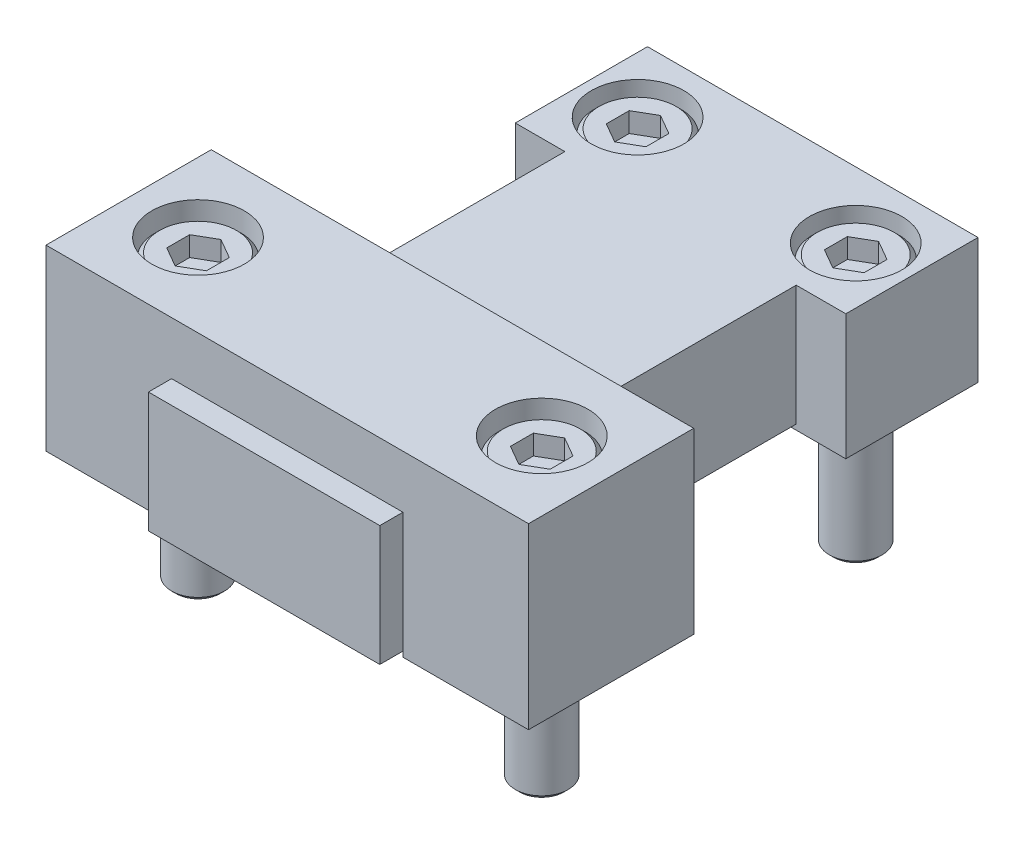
ISO-10303-21;
HEADER;
FILE_DESCRIPTION(('STEP AP214'),'2;1');
FILE_NAME('part.step','',(''),(''),'','','');
FILE_SCHEMA(('AUTOMOTIVE_DESIGN { 1 0 10303 214 1 1 1 1 }'));
ENDSEC;
DATA;
#1=APPLICATION_CONTEXT('core data for automotive mechanical design processes');
#2=APPLICATION_PROTOCOL_DEFINITION('international standard','automotive_design',2000,#1);
#3=PRODUCT_CONTEXT('',#1,'mechanical');
#4=PRODUCT('Part','Part','',(#3));
#5=PRODUCT_RELATED_PRODUCT_CATEGORY('part','',(#4));
#6=PRODUCT_DEFINITION_FORMATION('','',#4);
#7=PRODUCT_DEFINITION_CONTEXT('part definition',#1,'design');
#8=PRODUCT_DEFINITION('design','',#6,#7);
#9=PRODUCT_DEFINITION_SHAPE('','',#8);
#10=(LENGTH_UNIT() NAMED_UNIT(*) SI_UNIT(.MILLI.,.METRE.));
#11=(NAMED_UNIT(*) PLANE_ANGLE_UNIT() SI_UNIT($,.RADIAN.));
#12=(NAMED_UNIT(*) SI_UNIT($,.STERADIAN.) SOLID_ANGLE_UNIT());
#13=UNCERTAINTY_MEASURE_WITH_UNIT(LENGTH_MEASURE(1.E-05),#10,'distance_accuracy_value','');
#14=(GEOMETRIC_REPRESENTATION_CONTEXT(3) GLOBAL_UNCERTAINTY_ASSIGNED_CONTEXT((#13)) GLOBAL_UNIT_ASSIGNED_CONTEXT((#10,
#11,#12)) REPRESENTATION_CONTEXT('',''));
#15=CARTESIAN_POINT('',(0.,0.,0.));
#16=DIRECTION('',(0.,0.,1.));
#17=DIRECTION('',(1.,0.,0.));
#18=AXIS2_PLACEMENT_3D('',#15,#16,#17);
#19=CARTESIAN_POINT('',(-16.5,-17.5,-57.));
#20=DIRECTION('',(0.,1.,0.));
#21=DIRECTION('',(0.,0.,1.));
#22=AXIS2_PLACEMENT_3D('',#19,#20,#21);
#23=PLANE('',#22);
#24=CARTESIAN_POINT('',(-16.5,-17.5,-57.));
#25=DIRECTION('',(0.,-1.,0.));
#26=DIRECTION('',(0.,0.,1.));
#27=AXIS2_PLACEMENT_3D('',#24,#25,#26);
#28=CIRCLE('',#27,6.5);
#29=CARTESIAN_POINT('',(-16.5,-17.5,-50.5));
#30=VERTEX_POINT('',#29);
#31=EDGE_CURVE('E132',#30,#30,#28,.T.);
#32=ORIENTED_EDGE('',*,*,#31,.T.);
#33=EDGE_LOOP('',(#32));
#34=FACE_BOUND('',#33,.T.);
#35=CARTESIAN_POINT('',(-16.5,-17.5,-57.));
#36=DIRECTION('',(0.,-1.,0.));
#37=DIRECTION('',(0.,0.,1.));
#38=AXIS2_PLACEMENT_3D('',#35,#36,#37);
#39=CIRCLE('',#38,4.);
#40=CARTESIAN_POINT('',(-16.5,-17.5,-53.));
#41=VERTEX_POINT('',#40);
#42=EDGE_CURVE('E135',#41,#41,#39,.F.);
#43=ORIENTED_EDGE('',*,*,#42,.T.);
#44=EDGE_LOOP('',(#43));
#45=FACE_BOUND('',#44,.T.);
#46=ADVANCED_FACE('F42',(#34,#45),#23,.F.);
#47=CARTESIAN_POINT('',(-16.5,-9.5,-57.));
#48=DIRECTION('',(0.,-1.,0.));
#49=DIRECTION('',(0.,0.,-1.));
#50=AXIS2_PLACEMENT_3D('',#47,#48,#49);
#51=CYLINDRICAL_SURFACE('',#50,6.5);
#52=CARTESIAN_POINT('',(-16.5,-10.167,-57.));
#53=DIRECTION('',(0.,-1.,0.));
#54=DIRECTION('',(0.,0.,1.));
#55=AXIS2_PLACEMENT_3D('',#52,#53,#54);
#56=CIRCLE('',#55,6.5);
#57=CARTESIAN_POINT('',(-16.5,-10.167,-50.5));
#58=VERTEX_POINT('',#57);
#59=EDGE_CURVE('E13',#58,#58,#56,.F.);
#60=ORIENTED_EDGE('',*,*,#59,.F.);
#61=EDGE_LOOP('',(#60));
#62=FACE_BOUND('',#61,.T.);
#63=ORIENTED_EDGE('',*,*,#31,.F.);
#64=EDGE_LOOP('',(#63));
#65=FACE_BOUND('',#64,.T.);
#66=ADVANCED_FACE('F151',(#62,#65),#51,.T.);
#67=CARTESIAN_POINT('',(-16.5,-9.5,-57.));
#68=DIRECTION('',(0.,1.,0.));
#69=DIRECTION('',(0.,0.,1.));
#70=AXIS2_PLACEMENT_3D('',#67,#68,#69);
#71=PLANE('',#70);
#72=CARTESIAN_POINT('',(-16.5,-9.5,-57.));
#73=DIRECTION('',(0.,-1.,0.));
#74=DIRECTION('',(0.,0.,1.));
#75=AXIS2_PLACEMENT_3D('',#72,#73,#74);
#76=CIRCLE('',#75,5.833);
#77=CARTESIAN_POINT('',(-16.5,-9.5,-51.167));
#78=VERTEX_POINT('',#77);
#79=EDGE_CURVE('E50',#78,#78,#76,.T.);
#80=ORIENTED_EDGE('',*,*,#79,.F.);
#81=EDGE_LOOP('',(#80));
#82=FACE_BOUND('',#81,.T.);
#83=DIRECTION('',(-0.866025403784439,0.,0.5));
#84=VECTOR('',#83,1.);
#85=CARTESIAN_POINT('',(-13.5,-9.5,-55.2679491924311));
#86=LINE('',#85,#84);
#87=CARTESIAN_POINT('',(-13.5,-9.5,-55.2679491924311));
#88=VERTEX_POINT('',#87);
#89=CARTESIAN_POINT('',(-16.5,-9.5,-53.5358983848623));
#90=VERTEX_POINT('',#89);
#91=EDGE_CURVE('E155',#88,#90,#86,.T.);
#92=ORIENTED_EDGE('',*,*,#91,.T.);
#93=DIRECTION('',(-0.866025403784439,0.,-0.5));
#94=VECTOR('',#93,1.);
#95=CARTESIAN_POINT('',(-16.5,-9.5,-53.5358983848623));
#96=LINE('',#95,#94);
#97=CARTESIAN_POINT('',(-19.5,-9.5,-55.2679491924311));
#98=VERTEX_POINT('',#97);
#99=EDGE_CURVE('E157',#90,#98,#96,.T.);
#100=ORIENTED_EDGE('',*,*,#99,.T.);
#101=DIRECTION('',(0.,0.,-1.));
#102=VECTOR('',#101,1.);
#103=CARTESIAN_POINT('',(-19.5,-9.5,-55.2679491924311));
#104=LINE('',#103,#102);
#105=CARTESIAN_POINT('',(-19.5,-9.5,-58.7320508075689));
#106=VERTEX_POINT('',#105);
#107=EDGE_CURVE('E160',#98,#106,#104,.T.);
#108=ORIENTED_EDGE('',*,*,#107,.T.);
#109=DIRECTION('',(0.866025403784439,0.,-0.499999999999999));
#110=VECTOR('',#109,1.);
#111=CARTESIAN_POINT('',(-19.5,-9.5,-58.7320508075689));
#112=LINE('',#111,#110);
#113=CARTESIAN_POINT('',(-16.5,-9.5,-60.4641016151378));
#114=VERTEX_POINT('',#113);
#115=EDGE_CURVE('E165',#106,#114,#112,.T.);
#116=ORIENTED_EDGE('',*,*,#115,.T.);
#117=DIRECTION('',(0.866025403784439,0.,0.5));
#118=VECTOR('',#117,1.);
#119=CARTESIAN_POINT('',(-16.5,-9.5,-60.4641016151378));
#120=LINE('',#119,#118);
#121=CARTESIAN_POINT('',(-13.5,-9.5,-58.7320508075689));
#122=VERTEX_POINT('',#121);
#123=EDGE_CURVE('E121',#114,#122,#120,.T.);
#124=ORIENTED_EDGE('',*,*,#123,.T.);
#125=DIRECTION('',(0.,0.,1.));
#126=VECTOR('',#125,1.);
#127=CARTESIAN_POINT('',(-13.5,-9.5,-58.7320508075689));
#128=LINE('',#127,#126);
#129=EDGE_CURVE('E158',#122,#88,#128,.T.);
#130=ORIENTED_EDGE('',*,*,#129,.T.);
#131=EDGE_LOOP('',(#92,#100,#108,#116,#124,#130));
#132=FACE_BOUND('',#131,.T.);
#133=ADVANCED_FACE('F147',(#82,#132),#71,.T.);
#134=CARTESIAN_POINT('',(-13.5,-12.5,-55.2679491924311));
#135=DIRECTION('',(0.5,0.,0.866025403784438));
#136=DIRECTION('',(-0.866025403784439,0.,0.5));
#137=AXIS2_PLACEMENT_3D('',#134,#135,#136);
#138=PLANE('',#137);
#139=ORIENTED_EDGE('',*,*,#91,.F.);
#140=DIRECTION('',(0.,1.,0.));
#141=VECTOR('',#140,1.);
#142=CARTESIAN_POINT('',(-13.5,-12.5,-55.2679491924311));
#143=LINE('',#142,#141);
#144=CARTESIAN_POINT('',(-13.5,-12.5,-55.2679491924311));
#145=VERTEX_POINT('',#144);
#146=EDGE_CURVE('E88',#145,#88,#143,.T.);
#147=ORIENTED_EDGE('',*,*,#146,.F.);
#148=DIRECTION('',(-0.866025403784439,0.,0.5));
#149=VECTOR('',#148,1.);
#150=CARTESIAN_POINT('',(-13.5,-12.5,-55.2679491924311));
#151=LINE('',#150,#149);
#152=CARTESIAN_POINT('',(-16.5,-12.5,-53.5358983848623));
#153=VERTEX_POINT('',#152);
#154=EDGE_CURVE('E168',#145,#153,#151,.T.);
#155=ORIENTED_EDGE('',*,*,#154,.T.);
#156=DIRECTION('',(0.,1.,0.));
#157=VECTOR('',#156,1.);
#158=CARTESIAN_POINT('',(-16.5,-12.5,-53.5358983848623));
#159=LINE('',#158,#157);
#160=EDGE_CURVE('E57',#153,#90,#159,.T.);
#161=ORIENTED_EDGE('',*,*,#160,.T.);
#162=EDGE_LOOP('',(#139,#147,#155,#161));
#163=FACE_BOUND('',#162,.T.);
#164=ADVANCED_FACE('F150',(#163),#138,.F.);
#165=CARTESIAN_POINT('',(-13.5,-12.5,-58.7320508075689));
#166=DIRECTION('',(1.,0.,0.));
#167=DIRECTION('',(0.,0.,1.));
#168=AXIS2_PLACEMENT_3D('',#165,#166,#167);
#169=PLANE('',#168);
#170=ORIENTED_EDGE('',*,*,#129,.F.);
#171=DIRECTION('',(0.,1.,0.));
#172=VECTOR('',#171,1.);
#173=CARTESIAN_POINT('',(-13.5,-12.5,-58.7320508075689));
#174=LINE('',#173,#172);
#175=CARTESIAN_POINT('',(-13.5,-12.5,-58.7320508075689));
#176=VERTEX_POINT('',#175);
#177=EDGE_CURVE('E123',#176,#122,#174,.T.);
#178=ORIENTED_EDGE('',*,*,#177,.F.);
#179=DIRECTION('',(0.,0.,1.));
#180=VECTOR('',#179,1.);
#181=CARTESIAN_POINT('',(-13.5,-12.5,-58.7320508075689));
#182=LINE('',#181,#180);
#183=EDGE_CURVE('E66',#176,#145,#182,.T.);
#184=ORIENTED_EDGE('',*,*,#183,.T.);
#185=ORIENTED_EDGE('',*,*,#146,.T.);
#186=EDGE_LOOP('',(#170,#178,#184,#185));
#187=FACE_BOUND('',#186,.T.);
#188=ADVANCED_FACE('F219',(#187),#169,.F.);
#189=CARTESIAN_POINT('',(-16.5,-12.5,-60.4641016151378));
#190=DIRECTION('',(0.5,0.,-0.866025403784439));
#191=DIRECTION('',(0.866025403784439,0.,0.5));
#192=AXIS2_PLACEMENT_3D('',#189,#190,#191);
#193=PLANE('',#192);
#194=ORIENTED_EDGE('',*,*,#123,.F.);
#195=DIRECTION('',(0.,1.,0.));
#196=VECTOR('',#195,1.);
#197=CARTESIAN_POINT('',(-16.5,-12.5,-60.4641016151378));
#198=LINE('',#197,#196);
#199=CARTESIAN_POINT('',(-16.5,-12.5,-60.4641016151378));
#200=VERTEX_POINT('',#199);
#201=EDGE_CURVE('E110',#200,#114,#198,.T.);
#202=ORIENTED_EDGE('',*,*,#201,.F.);
#203=DIRECTION('',(0.866025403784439,0.,0.5));
#204=VECTOR('',#203,1.);
#205=CARTESIAN_POINT('',(-16.5,-12.5,-60.4641016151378));
#206=LINE('',#205,#204);
#207=EDGE_CURVE('E113',#200,#176,#206,.T.);
#208=ORIENTED_EDGE('',*,*,#207,.T.);
#209=ORIENTED_EDGE('',*,*,#177,.T.);
#210=EDGE_LOOP('',(#194,#202,#208,#209));
#211=FACE_BOUND('',#210,.T.);
#212=ADVANCED_FACE('F119',(#211),#193,.F.);
#213=CARTESIAN_POINT('',(-19.5,-12.5,-58.7320508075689));
#214=DIRECTION('',(-0.5,0.,-0.866025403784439));
#215=DIRECTION('',(0.866025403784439,0.,-0.5));
#216=AXIS2_PLACEMENT_3D('',#213,#214,#215);
#217=PLANE('',#216);
#218=ORIENTED_EDGE('',*,*,#115,.F.);
#219=DIRECTION('',(0.,1.,0.));
#220=VECTOR('',#219,1.);
#221=CARTESIAN_POINT('',(-19.5,-12.5,-58.7320508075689));
#222=LINE('',#221,#220);
#223=CARTESIAN_POINT('',(-19.5,-12.5,-58.7320508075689));
#224=VERTEX_POINT('',#223);
#225=EDGE_CURVE('E112',#224,#106,#222,.T.);
#226=ORIENTED_EDGE('',*,*,#225,.F.);
#227=DIRECTION('',(0.866025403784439,0.,-0.499999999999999));
#228=VECTOR('',#227,1.);
#229=CARTESIAN_POINT('',(-19.5,-12.5,-58.7320508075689));
#230=LINE('',#229,#228);
#231=EDGE_CURVE('E105',#224,#200,#230,.T.);
#232=ORIENTED_EDGE('',*,*,#231,.T.);
#233=ORIENTED_EDGE('',*,*,#201,.T.);
#234=EDGE_LOOP('',(#218,#226,#232,#233));
#235=FACE_BOUND('',#234,.T.);
#236=ADVANCED_FACE('F108',(#235),#217,.F.);
#237=CARTESIAN_POINT('',(-19.5,-12.5,-55.2679491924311));
#238=DIRECTION('',(-1.,0.,0.));
#239=DIRECTION('',(0.,0.,-1.));
#240=AXIS2_PLACEMENT_3D('',#237,#238,#239);
#241=PLANE('',#240);
#242=ORIENTED_EDGE('',*,*,#107,.F.);
#243=DIRECTION('',(0.,1.,0.));
#244=VECTOR('',#243,1.);
#245=CARTESIAN_POINT('',(-19.5,-12.5,-55.2679491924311));
#246=LINE('',#245,#244);
#247=CARTESIAN_POINT('',(-19.5,-12.5,-55.2679491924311));
#248=VERTEX_POINT('',#247);
#249=EDGE_CURVE('E126',#248,#98,#246,.T.);
#250=ORIENTED_EDGE('',*,*,#249,.F.);
#251=DIRECTION('',(0.,0.,-1.));
#252=VECTOR('',#251,1.);
#253=CARTESIAN_POINT('',(-19.5,-12.5,-55.2679491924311));
#254=LINE('',#253,#252);
#255=EDGE_CURVE('E114',#248,#224,#254,.T.);
#256=ORIENTED_EDGE('',*,*,#255,.T.);
#257=ORIENTED_EDGE('',*,*,#225,.T.);
#258=EDGE_LOOP('',(#242,#250,#256,#257));
#259=FACE_BOUND('',#258,.T.);
#260=ADVANCED_FACE('F175',(#259),#241,.F.);
#261=CARTESIAN_POINT('',(-16.5,-12.5,-53.5358983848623));
#262=DIRECTION('',(-0.5,0.,0.866025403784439));
#263=DIRECTION('',(-0.866025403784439,0.,-0.5));
#264=AXIS2_PLACEMENT_3D('',#261,#262,#263);
#265=PLANE('',#264);
#266=ORIENTED_EDGE('',*,*,#99,.F.);
#267=ORIENTED_EDGE('',*,*,#160,.F.);
#268=DIRECTION('',(-0.866025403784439,0.,-0.5));
#269=VECTOR('',#268,1.);
#270=CARTESIAN_POINT('',(-16.5,-12.5,-53.5358983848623));
#271=LINE('',#270,#269);
#272=EDGE_CURVE('E96',#153,#248,#271,.T.);
#273=ORIENTED_EDGE('',*,*,#272,.T.);
#274=ORIENTED_EDGE('',*,*,#249,.T.);
#275=EDGE_LOOP('',(#266,#267,#273,#274));
#276=FACE_BOUND('',#275,.T.);
#277=ADVANCED_FACE('F177',(#276),#265,.F.);
#278=CARTESIAN_POINT('',(-16.5,-12.5,-53.5358983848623));
#279=DIRECTION('',(0.,1.,0.));
#280=DIRECTION('',(0.,0.,1.));
#281=AXIS2_PLACEMENT_3D('',#278,#279,#280);
#282=PLANE('',#281);
#283=ORIENTED_EDGE('',*,*,#154,.F.);
#284=ORIENTED_EDGE('',*,*,#183,.F.);
#285=ORIENTED_EDGE('',*,*,#207,.F.);
#286=ORIENTED_EDGE('',*,*,#231,.F.);
#287=ORIENTED_EDGE('',*,*,#255,.F.);
#288=ORIENTED_EDGE('',*,*,#272,.F.);
#289=EDGE_LOOP('',(#283,#284,#285,#286,#287,#288));
#290=FACE_BOUND('',#289,.T.);
#291=ADVANCED_FACE('F116',(#290),#282,.T.);
#292=CARTESIAN_POINT('',(-16.5,-47.5,-57.));
#293=DIRECTION('',(0.,1.,0.));
#294=DIRECTION('',(0.,0.,1.));
#295=AXIS2_PLACEMENT_3D('',#292,#293,#294);
#296=CYLINDRICAL_SURFACE('',#295,4.);
#297=CARTESIAN_POINT('',(-16.5,-46.833,-57.));
#298=DIRECTION('',(0.,1.,0.));
#299=DIRECTION('',(0.,0.,-1.));
#300=AXIS2_PLACEMENT_3D('',#297,#298,#299);
#301=CIRCLE('',#300,4.);
#302=CARTESIAN_POINT('',(-16.5,-46.833,-61.));
#303=VERTEX_POINT('',#302);
#304=EDGE_CURVE('E141',#303,#303,#301,.F.);
#305=ORIENTED_EDGE('',*,*,#304,.F.);
#306=EDGE_LOOP('',(#305));
#307=FACE_BOUND('',#306,.T.);
#308=ORIENTED_EDGE('',*,*,#42,.F.);
#309=EDGE_LOOP('',(#308));
#310=FACE_BOUND('',#309,.T.);
#311=ADVANCED_FACE('F184',(#307,#310),#296,.T.);
#312=CARTESIAN_POINT('',(-16.5,-47.5,-57.));
#313=DIRECTION('',(0.,-1.,0.));
#314=DIRECTION('',(0.,0.,-1.));
#315=AXIS2_PLACEMENT_3D('',#312,#313,#314);
#316=PLANE('',#315);
#317=CARTESIAN_POINT('',(-16.5,-47.5,-57.));
#318=DIRECTION('',(0.,1.,0.));
#319=DIRECTION('',(0.,0.,-1.));
#320=AXIS2_PLACEMENT_3D('',#317,#318,#319);
#321=CIRCLE('',#320,3.333);
#322=CARTESIAN_POINT('',(-16.5,-47.5,-60.333));
#323=VERTEX_POINT('',#322);
#324=EDGE_CURVE('E138',#323,#323,#321,.T.);
#325=ORIENTED_EDGE('',*,*,#324,.F.);
#326=EDGE_LOOP('',(#325));
#327=FACE_BOUND('',#326,.T.);
#328=ADVANCED_FACE('F199',(#327),#316,.T.);
#329=CARTESIAN_POINT('',(-16.5,-47.5,-57.));
#330=DIRECTION('',(0.,1.,0.));
#331=DIRECTION('',(0.,0.,1.));
#332=AXIS2_PLACEMENT_3D('',#329,#330,#331);
#333=CONICAL_SURFACE('',#332,3.333,0.785398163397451);
#334=ORIENTED_EDGE('',*,*,#304,.T.);
#335=EDGE_LOOP('',(#334));
#336=FACE_BOUND('',#335,.T.);
#337=ORIENTED_EDGE('',*,*,#324,.T.);
#338=EDGE_LOOP('',(#337));
#339=FACE_BOUND('',#338,.T.);
#340=ADVANCED_FACE('F197',(#336,#339),#333,.T.);
#341=CARTESIAN_POINT('',(-16.5,-9.5,-57.));
#342=DIRECTION('',(0.,-1.,0.));
#343=DIRECTION('',(0.,0.,-1.));
#344=AXIS2_PLACEMENT_3D('',#341,#342,#343);
#345=CONICAL_SURFACE('',#344,5.833,0.785398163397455);
#346=ORIENTED_EDGE('',*,*,#59,.T.);
#347=EDGE_LOOP('',(#346));
#348=FACE_BOUND('',#347,.T.);
#349=ORIENTED_EDGE('',*,*,#79,.T.);
#350=EDGE_LOOP('',(#349));
#351=FACE_BOUND('',#350,.T.);
#352=ADVANCED_FACE('F44',(#348,#351),#345,.T.);
#353=CLOSED_SHELL('',(#46,#66,#133,#164,#188,#212,#236,#260,#277,#291,#311,#328,#340,#352));
#354=MANIFOLD_SOLID_BREP('B2',#353);
#355=CARTESIAN_POINT('',(-26.,-10.,0.));
#356=DIRECTION('',(0.,1.,0.));
#357=DIRECTION('',(0.,0.,1.));
#358=AXIS2_PLACEMENT_3D('',#355,#356,#357);
#359=PLANE('',#358);
#360=CARTESIAN_POINT('',(-26.,-10.,0.));
#361=DIRECTION('',(0.,-1.,0.));
#362=DIRECTION('',(0.,0.,1.));
#363=AXIS2_PLACEMENT_3D('',#360,#361,#362);
#364=CIRCLE('',#363,6.5);
#365=CARTESIAN_POINT('',(-26.,-10.,6.49999999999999));
#366=VERTEX_POINT('',#365);
#367=EDGE_CURVE('E407',#366,#366,#364,.T.);
#368=ORIENTED_EDGE('',*,*,#367,.T.);
#369=EDGE_LOOP('',(#368));
#370=FACE_BOUND('',#369,.T.);
#371=CARTESIAN_POINT('',(-26.,-10.,0.));
#372=DIRECTION('',(0.,-1.,0.));
#373=DIRECTION('',(0.,0.,1.));
#374=AXIS2_PLACEMENT_3D('',#371,#372,#373);
#375=CIRCLE('',#374,4.);
#376=CARTESIAN_POINT('',(-26.,-10.,3.99999999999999));
#377=VERTEX_POINT('',#376);
#378=EDGE_CURVE('E410',#377,#377,#375,.F.);
#379=ORIENTED_EDGE('',*,*,#378,.T.);
#380=EDGE_LOOP('',(#379));
#381=FACE_BOUND('',#380,.T.);
#382=ADVANCED_FACE('F317',(#370,#381),#359,.F.);
#383=CARTESIAN_POINT('',(-26.,-2.,0.));
#384=DIRECTION('',(0.,-1.,0.));
#385=DIRECTION('',(0.,0.,-1.));
#386=AXIS2_PLACEMENT_3D('',#383,#384,#385);
#387=CYLINDRICAL_SURFACE('',#386,6.5);
#388=CARTESIAN_POINT('',(-26.,-2.667,0.));
#389=DIRECTION('',(0.,-1.,0.));
#390=DIRECTION('',(0.,0.,1.));
#391=AXIS2_PLACEMENT_3D('',#388,#389,#390);
#392=CIRCLE('',#391,6.5);
#393=CARTESIAN_POINT('',(-26.,-2.667,6.49999999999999));
#394=VERTEX_POINT('',#393);
#395=EDGE_CURVE('E40',#394,#394,#392,.F.);
#396=ORIENTED_EDGE('',*,*,#395,.F.);
#397=EDGE_LOOP('',(#396));
#398=FACE_BOUND('',#397,.T.);
#399=ORIENTED_EDGE('',*,*,#367,.F.);
#400=EDGE_LOOP('',(#399));
#401=FACE_BOUND('',#400,.T.);
#402=ADVANCED_FACE('F426',(#398,#401),#387,.T.);
#403=CARTESIAN_POINT('',(-26.,-2.,0.));
#404=DIRECTION('',(0.,1.,0.));
#405=DIRECTION('',(0.,0.,1.));
#406=AXIS2_PLACEMENT_3D('',#403,#404,#405);
#407=PLANE('',#406);
#408=CARTESIAN_POINT('',(-26.,-2.,0.));
#409=DIRECTION('',(0.,-1.,0.));
#410=DIRECTION('',(0.,0.,1.));
#411=AXIS2_PLACEMENT_3D('',#408,#409,#410);
#412=CIRCLE('',#411,5.833);
#413=CARTESIAN_POINT('',(-26.,-2.,5.83299999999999));
#414=VERTEX_POINT('',#413);
#415=EDGE_CURVE('E325',#414,#414,#412,.T.);
#416=ORIENTED_EDGE('',*,*,#415,.F.);
#417=EDGE_LOOP('',(#416));
#418=FACE_BOUND('',#417,.T.);
#419=DIRECTION('',(0.,0.,-1.));
#420=VECTOR('',#419,1.);
#421=CARTESIAN_POINT('',(-29.,-2.,1.73205080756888));
#422=LINE('',#421,#420);
#423=CARTESIAN_POINT('',(-29.,-2.,1.73205080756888));
#424=VERTEX_POINT('',#423);
#425=CARTESIAN_POINT('',(-29.,-2.,-1.73205080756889));
#426=VERTEX_POINT('',#425);
#427=EDGE_CURVE('E430',#424,#426,#422,.T.);
#428=ORIENTED_EDGE('',*,*,#427,.T.);
#429=DIRECTION('',(0.866025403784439,0.,-0.5));
#430=VECTOR('',#429,1.);
#431=CARTESIAN_POINT('',(-29.,-2.,-1.73205080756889));
#432=LINE('',#431,#430);
#433=CARTESIAN_POINT('',(-26.,-2.,-3.46410161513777));
#434=VERTEX_POINT('',#433);
#435=EDGE_CURVE('E432',#426,#434,#432,.T.);
#436=ORIENTED_EDGE('',*,*,#435,.T.);
#437=DIRECTION('',(0.866025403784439,0.,0.5));
#438=VECTOR('',#437,1.);
#439=CARTESIAN_POINT('',(-26.,-2.,-3.46410161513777));
#440=LINE('',#439,#438);
#441=CARTESIAN_POINT('',(-23.,-2.,-1.73205080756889));
#442=VERTEX_POINT('',#441);
#443=EDGE_CURVE('E435',#434,#442,#440,.T.);
#444=ORIENTED_EDGE('',*,*,#443,.T.);
#445=DIRECTION('',(0.,0.,1.));
#446=VECTOR('',#445,1.);
#447=CARTESIAN_POINT('',(-23.,-2.,-1.73205080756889));
#448=LINE('',#447,#446);
#449=CARTESIAN_POINT('',(-23.,-2.,1.73205080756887));
#450=VERTEX_POINT('',#449);
#451=EDGE_CURVE('E440',#442,#450,#448,.T.);
#452=ORIENTED_EDGE('',*,*,#451,.T.);
#453=DIRECTION('',(-0.866025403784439,0.,0.5));
#454=VECTOR('',#453,1.);
#455=CARTESIAN_POINT('',(-23.,-2.,1.73205080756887));
#456=LINE('',#455,#454);
#457=CARTESIAN_POINT('',(-26.,-2.,3.46410161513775));
#458=VERTEX_POINT('',#457);
#459=EDGE_CURVE('E396',#450,#458,#456,.T.);
#460=ORIENTED_EDGE('',*,*,#459,.T.);
#461=DIRECTION('',(-0.866025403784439,0.,-0.5));
#462=VECTOR('',#461,1.);
#463=CARTESIAN_POINT('',(-26.,-2.,3.46410161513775));
#464=LINE('',#463,#462);
#465=EDGE_CURVE('E433',#458,#424,#464,.T.);
#466=ORIENTED_EDGE('',*,*,#465,.T.);
#467=EDGE_LOOP('',(#428,#436,#444,#452,#460,#466));
#468=FACE_BOUND('',#467,.T.);
#469=ADVANCED_FACE('F422',(#418,#468),#407,.T.);
#470=CARTESIAN_POINT('',(-26.,-45.,0.));
#471=DIRECTION('',(0.,1.,0.));
#472=DIRECTION('',(0.,0.,1.));
#473=AXIS2_PLACEMENT_3D('',#470,#471,#472);
#474=CYLINDRICAL_SURFACE('',#473,4.);
#475=CARTESIAN_POINT('',(-26.,-44.333,0.));
#476=DIRECTION('',(0.,1.,0.));
#477=DIRECTION('',(0.,0.,-1.));
#478=AXIS2_PLACEMENT_3D('',#475,#476,#477);
#479=CIRCLE('',#478,4.);
#480=CARTESIAN_POINT('',(-26.,-44.333,-4.00000000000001));
#481=VERTEX_POINT('',#480);
#482=EDGE_CURVE('E416',#481,#481,#479,.F.);
#483=ORIENTED_EDGE('',*,*,#482,.F.);
#484=EDGE_LOOP('',(#483));
#485=FACE_BOUND('',#484,.T.);
#486=ORIENTED_EDGE('',*,*,#378,.F.);
#487=EDGE_LOOP('',(#486));
#488=FACE_BOUND('',#487,.T.);
#489=ADVANCED_FACE('F425',(#485,#488),#474,.T.);
#490=CARTESIAN_POINT('',(-26.,-45.,0.));
#491=DIRECTION('',(0.,-1.,0.));
#492=DIRECTION('',(0.,0.,-1.));
#493=AXIS2_PLACEMENT_3D('',#490,#491,#492);
#494=PLANE('',#493);
#495=CARTESIAN_POINT('',(-26.,-45.,0.));
#496=DIRECTION('',(0.,1.,0.));
#497=DIRECTION('',(0.,0.,-1.));
#498=AXIS2_PLACEMENT_3D('',#495,#496,#497);
#499=CIRCLE('',#498,3.33300000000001);
#500=CARTESIAN_POINT('',(-26.,-45.,-3.33300000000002));
#501=VERTEX_POINT('',#500);
#502=EDGE_CURVE('E413',#501,#501,#499,.T.);
#503=ORIENTED_EDGE('',*,*,#502,.F.);
#504=EDGE_LOOP('',(#503));
#505=FACE_BOUND('',#504,.T.);
#506=ADVANCED_FACE('F483',(#505),#494,.T.);
#507=CARTESIAN_POINT('',(-29.,-5.,1.73205080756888));
#508=DIRECTION('',(-1.,0.,0.));
#509=DIRECTION('',(0.,0.,-1.));
#510=AXIS2_PLACEMENT_3D('',#507,#508,#509);
#511=PLANE('',#510);
#512=ORIENTED_EDGE('',*,*,#427,.F.);
#513=DIRECTION('',(0.,1.,0.));
#514=VECTOR('',#513,1.);
#515=CARTESIAN_POINT('',(-29.,-5.,1.73205080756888));
#516=LINE('',#515,#514);
#517=CARTESIAN_POINT('',(-29.,-5.,1.73205080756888));
#518=VERTEX_POINT('',#517);
#519=EDGE_CURVE('E363',#518,#424,#516,.T.);
#520=ORIENTED_EDGE('',*,*,#519,.F.);
#521=DIRECTION('',(0.,0.,-1.));
#522=VECTOR('',#521,1.);
#523=CARTESIAN_POINT('',(-29.,-5.,1.73205080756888));
#524=LINE('',#523,#522);
#525=CARTESIAN_POINT('',(-29.,-5.,-1.73205080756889));
#526=VERTEX_POINT('',#525);
#527=EDGE_CURVE('E443',#518,#526,#524,.T.);
#528=ORIENTED_EDGE('',*,*,#527,.T.);
#529=DIRECTION('',(0.,1.,0.));
#530=VECTOR('',#529,1.);
#531=CARTESIAN_POINT('',(-29.,-5.,-1.73205080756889));
#532=LINE('',#531,#530);
#533=EDGE_CURVE('E332',#526,#426,#532,.T.);
#534=ORIENTED_EDGE('',*,*,#533,.T.);
#535=EDGE_LOOP('',(#512,#520,#528,#534));
#536=FACE_BOUND('',#535,.T.);
#537=ADVANCED_FACE('F485',(#536),#511,.F.);
#538=CARTESIAN_POINT('',(-26.,-5.,3.46410161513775));
#539=DIRECTION('',(-0.5,0.,0.866025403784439));
#540=DIRECTION('',(-0.866025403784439,0.,-0.5));
#541=AXIS2_PLACEMENT_3D('',#538,#539,#540);
#542=PLANE('',#541);
#543=ORIENTED_EDGE('',*,*,#465,.F.);
#544=DIRECTION('',(0.,1.,0.));
#545=VECTOR('',#544,1.);
#546=CARTESIAN_POINT('',(-26.,-5.,3.46410161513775));
#547=LINE('',#546,#545);
#548=CARTESIAN_POINT('',(-26.,-5.,3.46410161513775));
#549=VERTEX_POINT('',#548);
#550=EDGE_CURVE('E398',#549,#458,#547,.T.);
#551=ORIENTED_EDGE('',*,*,#550,.F.);
#552=DIRECTION('',(-0.866025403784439,0.,-0.5));
#553=VECTOR('',#552,1.);
#554=CARTESIAN_POINT('',(-26.,-5.,3.46410161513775));
#555=LINE('',#554,#553);
#556=EDGE_CURVE('E341',#549,#518,#555,.T.);
#557=ORIENTED_EDGE('',*,*,#556,.T.);
#558=ORIENTED_EDGE('',*,*,#519,.T.);
#559=EDGE_LOOP('',(#543,#551,#557,#558));
#560=FACE_BOUND('',#559,.T.);
#561=ADVANCED_FACE('F491',(#560),#542,.F.);
#562=CARTESIAN_POINT('',(-23.,-5.,1.73205080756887));
#563=DIRECTION('',(0.5,0.,0.866025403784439));
#564=DIRECTION('',(-0.866025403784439,0.,0.5));
#565=AXIS2_PLACEMENT_3D('',#562,#563,#564);
#566=PLANE('',#565);
#567=ORIENTED_EDGE('',*,*,#459,.F.);
#568=DIRECTION('',(0.,1.,0.));
#569=VECTOR('',#568,1.);
#570=CARTESIAN_POINT('',(-23.,-5.,1.73205080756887));
#571=LINE('',#570,#569);
#572=CARTESIAN_POINT('',(-23.,-5.,1.73205080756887));
#573=VERTEX_POINT('',#572);
#574=EDGE_CURVE('E385',#573,#450,#571,.T.);
#575=ORIENTED_EDGE('',*,*,#574,.F.);
#576=DIRECTION('',(-0.866025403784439,0.,0.5));
#577=VECTOR('',#576,1.);
#578=CARTESIAN_POINT('',(-23.,-5.,1.73205080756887));
#579=LINE('',#578,#577);
#580=EDGE_CURVE('E388',#573,#549,#579,.T.);
#581=ORIENTED_EDGE('',*,*,#580,.T.);
#582=ORIENTED_EDGE('',*,*,#550,.T.);
#583=EDGE_LOOP('',(#567,#575,#581,#582));
#584=FACE_BOUND('',#583,.T.);
#585=ADVANCED_FACE('F394',(#584),#566,.F.);
#586=CARTESIAN_POINT('',(-23.,-5.,-1.73205080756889));
#587=DIRECTION('',(1.,0.,0.));
#588=DIRECTION('',(0.,0.,1.));
#589=AXIS2_PLACEMENT_3D('',#586,#587,#588);
#590=PLANE('',#589);
#591=ORIENTED_EDGE('',*,*,#451,.F.);
#592=DIRECTION('',(0.,1.,0.));
#593=VECTOR('',#592,1.);
#594=CARTESIAN_POINT('',(-23.,-5.,-1.73205080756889));
#595=LINE('',#594,#593);
#596=CARTESIAN_POINT('',(-23.,-5.,-1.73205080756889));
#597=VERTEX_POINT('',#596);
#598=EDGE_CURVE('E387',#597,#442,#595,.T.);
#599=ORIENTED_EDGE('',*,*,#598,.F.);
#600=DIRECTION('',(0.,0.,1.));
#601=VECTOR('',#600,1.);
#602=CARTESIAN_POINT('',(-23.,-5.,-1.73205080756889));
#603=LINE('',#602,#601);
#604=EDGE_CURVE('E380',#597,#573,#603,.T.);
#605=ORIENTED_EDGE('',*,*,#604,.T.);
#606=ORIENTED_EDGE('',*,*,#574,.T.);
#607=EDGE_LOOP('',(#591,#599,#605,#606));
#608=FACE_BOUND('',#607,.T.);
#609=ADVANCED_FACE('F383',(#608),#590,.F.);
#610=CARTESIAN_POINT('',(-26.,-5.,-3.46410161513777));
#611=DIRECTION('',(0.5,0.,-0.866025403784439));
#612=DIRECTION('',(0.866025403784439,0.,0.5));
#613=AXIS2_PLACEMENT_3D('',#610,#611,#612);
#614=PLANE('',#613);
#615=ORIENTED_EDGE('',*,*,#443,.F.);
#616=DIRECTION('',(0.,1.,0.));
#617=VECTOR('',#616,1.);
#618=CARTESIAN_POINT('',(-26.,-5.,-3.46410161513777));
#619=LINE('',#618,#617);
#620=CARTESIAN_POINT('',(-26.,-5.,-3.46410161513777));
#621=VERTEX_POINT('',#620);
#622=EDGE_CURVE('E401',#621,#434,#619,.T.);
#623=ORIENTED_EDGE('',*,*,#622,.F.);
#624=DIRECTION('',(0.866025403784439,0.,0.5));
#625=VECTOR('',#624,1.);
#626=CARTESIAN_POINT('',(-26.,-5.,-3.46410161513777));
#627=LINE('',#626,#625);
#628=EDGE_CURVE('E389',#621,#597,#627,.T.);
#629=ORIENTED_EDGE('',*,*,#628,.T.);
#630=ORIENTED_EDGE('',*,*,#598,.T.);
#631=EDGE_LOOP('',(#615,#623,#629,#630));
#632=FACE_BOUND('',#631,.T.);
#633=ADVANCED_FACE('F450',(#632),#614,.F.);
#634=CARTESIAN_POINT('',(-29.,-5.,-1.73205080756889));
#635=DIRECTION('',(-0.5,0.,-0.866025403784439));
#636=DIRECTION('',(0.866025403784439,0.,-0.5));
#637=AXIS2_PLACEMENT_3D('',#634,#635,#636);
#638=PLANE('',#637);
#639=ORIENTED_EDGE('',*,*,#435,.F.);
#640=ORIENTED_EDGE('',*,*,#533,.F.);
#641=DIRECTION('',(0.866025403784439,0.,-0.5));
#642=VECTOR('',#641,1.);
#643=CARTESIAN_POINT('',(-29.,-5.,-1.73205080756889));
#644=LINE('',#643,#642);
#645=EDGE_CURVE('E371',#526,#621,#644,.T.);
#646=ORIENTED_EDGE('',*,*,#645,.T.);
#647=ORIENTED_EDGE('',*,*,#622,.T.);
#648=EDGE_LOOP('',(#639,#640,#646,#647));
#649=FACE_BOUND('',#648,.T.);
#650=ADVANCED_FACE('F452',(#649),#638,.F.);
#651=CARTESIAN_POINT('',(-29.,-5.,-1.73205080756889));
#652=DIRECTION('',(0.,1.,0.));
#653=DIRECTION('',(0.,0.,1.));
#654=AXIS2_PLACEMENT_3D('',#651,#652,#653);
#655=PLANE('',#654);
#656=ORIENTED_EDGE('',*,*,#527,.F.);
#657=ORIENTED_EDGE('',*,*,#556,.F.);
#658=ORIENTED_EDGE('',*,*,#580,.F.);
#659=ORIENTED_EDGE('',*,*,#604,.F.);
#660=ORIENTED_EDGE('',*,*,#628,.F.);
#661=ORIENTED_EDGE('',*,*,#645,.F.);
#662=EDGE_LOOP('',(#656,#657,#658,#659,#660,#661));
#663=FACE_BOUND('',#662,.T.);
#664=ADVANCED_FACE('F391',(#663),#655,.T.);
#665=CARTESIAN_POINT('',(-26.,-45.,0.));
#666=DIRECTION('',(0.,1.,0.));
#667=DIRECTION('',(0.,0.,1.));
#668=AXIS2_PLACEMENT_3D('',#665,#666,#667);
#669=CONICAL_SURFACE('',#668,3.33300000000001,0.78539816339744);
#670=ORIENTED_EDGE('',*,*,#482,.T.);
#671=EDGE_LOOP('',(#670));
#672=FACE_BOUND('',#671,.T.);
#673=ORIENTED_EDGE('',*,*,#502,.T.);
#674=EDGE_LOOP('',(#673));
#675=FACE_BOUND('',#674,.T.);
#676=ADVANCED_FACE('F459',(#672,#675),#669,.T.);
#677=CARTESIAN_POINT('',(-26.,-2.,0.));
#678=DIRECTION('',(0.,-1.,0.));
#679=DIRECTION('',(0.,0.,-1.));
#680=AXIS2_PLACEMENT_3D('',#677,#678,#679);
#681=CONICAL_SURFACE('',#680,5.833,0.785398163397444);
#682=ORIENTED_EDGE('',*,*,#395,.T.);
#683=EDGE_LOOP('',(#682));
#684=FACE_BOUND('',#683,.T.);
#685=ORIENTED_EDGE('',*,*,#415,.T.);
#686=EDGE_LOOP('',(#685));
#687=FACE_BOUND('',#686,.T.);
#688=ADVANCED_FACE('F319',(#684,#687),#681,.T.);
#689=CLOSED_SHELL('',(#382,#402,#469,#489,#506,#537,#561,#585,#609,#633,#650,#664,#676,#688));
#690=MANIFOLD_SOLID_BREP('B7',#689);
#691=CARTESIAN_POINT('',(16.5,-17.5,-57.));
#692=DIRECTION('',(0.,1.,0.));
#693=DIRECTION('',(0.,0.,1.));
#694=AXIS2_PLACEMENT_3D('',#691,#692,#693);
#695=PLANE('',#694);
#696=CARTESIAN_POINT('',(16.5,-17.5,-57.));
#697=DIRECTION('',(0.,1.,0.));
#698=DIRECTION('',(0.,0.,1.));
#699=AXIS2_PLACEMENT_3D('',#696,#697,#698);
#700=CIRCLE('',#699,6.5);
#701=CARTESIAN_POINT('',(16.5,-17.5,-50.5));
#702=VERTEX_POINT('',#701);
#703=EDGE_CURVE('E694',#702,#702,#700,.T.);
#704=ORIENTED_EDGE('',*,*,#703,.F.);
#705=EDGE_LOOP('',(#704));
#706=FACE_BOUND('',#705,.T.);
#707=CARTESIAN_POINT('',(16.5,-17.5,-57.));
#708=DIRECTION('',(0.,1.,0.));
#709=DIRECTION('',(0.,0.,1.));
#710=AXIS2_PLACEMENT_3D('',#707,#708,#709);
#711=CIRCLE('',#710,4.);
#712=CARTESIAN_POINT('',(16.5,-17.5,-53.));
#713=VERTEX_POINT('',#712);
#714=EDGE_CURVE('E702',#713,#713,#711,.F.);
#715=ORIENTED_EDGE('',*,*,#714,.F.);
#716=EDGE_LOOP('',(#715));
#717=FACE_BOUND('',#716,.T.);
#718=ADVANCED_FACE('F592',(#706,#717),#695,.F.);
#719=CARTESIAN_POINT('',(16.5,-9.5,-57.));
#720=DIRECTION('',(0.,-1.,0.));
#721=DIRECTION('',(0.,0.,-1.));
#722=AXIS2_PLACEMENT_3D('',#719,#720,#721);
#723=CYLINDRICAL_SURFACE('',#722,6.5);
#724=CARTESIAN_POINT('',(16.5,-10.167,-57.));
#725=DIRECTION('',(0.,1.,0.));
#726=DIRECTION('',(0.,0.,1.));
#727=AXIS2_PLACEMENT_3D('',#724,#725,#726);
#728=CIRCLE('',#727,6.5);
#729=CARTESIAN_POINT('',(16.5,-10.167,-50.5));
#730=VERTEX_POINT('',#729);
#731=EDGE_CURVE('E315',#730,#730,#728,.F.);
#732=ORIENTED_EDGE('',*,*,#731,.T.);
#733=EDGE_LOOP('',(#732));
#734=FACE_BOUND('',#733,.T.);
#735=ORIENTED_EDGE('',*,*,#703,.T.);
#736=EDGE_LOOP('',(#735));
#737=FACE_BOUND('',#736,.T.);
#738=ADVANCED_FACE('F726',(#734,#737),#723,.T.);
#739=CARTESIAN_POINT('',(16.5,-9.5,-57.));
#740=DIRECTION('',(0.,1.,0.));
#741=DIRECTION('',(0.,0.,1.));
#742=AXIS2_PLACEMENT_3D('',#739,#740,#741);
#743=PLANE('',#742);
#744=CARTESIAN_POINT('',(16.5,-9.5,-57.));
#745=DIRECTION('',(0.,1.,0.));
#746=DIRECTION('',(0.,0.,1.));
#747=AXIS2_PLACEMENT_3D('',#744,#745,#746);
#748=CIRCLE('',#747,5.833);
#749=CARTESIAN_POINT('',(16.5,-9.5,-51.167));
#750=VERTEX_POINT('',#749);
#751=EDGE_CURVE('E600',#750,#750,#748,.T.);
#752=ORIENTED_EDGE('',*,*,#751,.T.);
#753=EDGE_LOOP('',(#752));
#754=FACE_BOUND('',#753,.T.);
#755=DIRECTION('',(0.866025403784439,0.,0.5));
#756=VECTOR('',#755,1.);
#757=CARTESIAN_POINT('',(13.5,-9.5,-55.2679491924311));
#758=LINE('',#757,#756);
#759=CARTESIAN_POINT('',(13.5,-9.5,-55.2679491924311));
#760=VERTEX_POINT('',#759);
#761=CARTESIAN_POINT('',(16.5,-9.5,-53.5358983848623));
#762=VERTEX_POINT('',#761);
#763=EDGE_CURVE('E607',#760,#762,#758,.T.);
#764=ORIENTED_EDGE('',*,*,#763,.F.);
#765=DIRECTION('',(0.,0.,1.));
#766=VECTOR('',#765,1.);
#767=CARTESIAN_POINT('',(13.5,-9.5,-58.7320508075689));
#768=LINE('',#767,#766);
#769=CARTESIAN_POINT('',(13.5,-9.5,-58.7320508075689));
#770=VERTEX_POINT('',#769);
#771=EDGE_CURVE('E690',#770,#760,#768,.T.);
#772=ORIENTED_EDGE('',*,*,#771,.F.);
#773=DIRECTION('',(-0.866025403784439,0.,0.5));
#774=VECTOR('',#773,1.);
#775=CARTESIAN_POINT('',(16.5,-9.5,-60.4641016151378));
#776=LINE('',#775,#774);
#777=CARTESIAN_POINT('',(16.5,-9.5,-60.4641016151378));
#778=VERTEX_POINT('',#777);
#779=EDGE_CURVE('E688',#778,#770,#776,.T.);
#780=ORIENTED_EDGE('',*,*,#779,.F.);
#781=DIRECTION('',(-0.866025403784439,0.,-0.499999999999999));
#782=VECTOR('',#781,1.);
#783=CARTESIAN_POINT('',(19.5,-9.5,-58.7320508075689));
#784=LINE('',#783,#782);
#785=CARTESIAN_POINT('',(19.5,-9.5,-58.7320508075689));
#786=VERTEX_POINT('',#785);
#787=EDGE_CURVE('E655',#786,#778,#784,.T.);
#788=ORIENTED_EDGE('',*,*,#787,.F.);
#789=DIRECTION('',(0.,0.,-1.));
#790=VECTOR('',#789,1.);
#791=CARTESIAN_POINT('',(19.5,-9.5,-55.2679491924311));
#792=LINE('',#791,#790);
#793=CARTESIAN_POINT('',(19.5,-9.5,-55.2679491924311));
#794=VERTEX_POINT('',#793);
#795=EDGE_CURVE('E684',#794,#786,#792,.T.);
#796=ORIENTED_EDGE('',*,*,#795,.F.);
#797=DIRECTION('',(0.866025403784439,0.,-0.5));
#798=VECTOR('',#797,1.);
#799=CARTESIAN_POINT('',(16.5,-9.5,-53.5358983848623));
#800=LINE('',#799,#798);
#801=EDGE_CURVE('E681',#762,#794,#800,.T.);
#802=ORIENTED_EDGE('',*,*,#801,.F.);
#803=EDGE_LOOP('',(#764,#772,#780,#788,#796,#802));
#804=FACE_BOUND('',#803,.T.);
#805=ADVANCED_FACE('F713',(#754,#804),#743,.T.);
#806=CARTESIAN_POINT('',(13.5,-12.5,-55.2679491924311));
#807=DIRECTION('',(-0.5,0.,0.866025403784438));
#808=DIRECTION('',(0.866025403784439,0.,0.5));
#809=AXIS2_PLACEMENT_3D('',#806,#807,#808);
#810=PLANE('',#809);
#811=ORIENTED_EDGE('',*,*,#763,.T.);
#812=DIRECTION('',(0.,1.,0.));
#813=VECTOR('',#812,1.);
#814=CARTESIAN_POINT('',(16.5,-12.5,-53.5358983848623));
#815=LINE('',#814,#813);
#816=CARTESIAN_POINT('',(16.5,-12.5,-53.5358983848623));
#817=VERTEX_POINT('',#816);
#818=EDGE_CURVE('E637',#817,#762,#815,.T.);
#819=ORIENTED_EDGE('',*,*,#818,.F.);
#820=DIRECTION('',(0.866025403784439,0.,0.5));
#821=VECTOR('',#820,1.);
#822=CARTESIAN_POINT('',(13.5,-12.5,-55.2679491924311));
#823=LINE('',#822,#821);
#824=CARTESIAN_POINT('',(13.5,-12.5,-55.2679491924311));
#825=VERTEX_POINT('',#824);
#826=EDGE_CURVE('E692',#825,#817,#823,.T.);
#827=ORIENTED_EDGE('',*,*,#826,.F.);
#828=DIRECTION('',(0.,1.,0.));
#829=VECTOR('',#828,1.);
#830=CARTESIAN_POINT('',(13.5,-12.5,-55.2679491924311));
#831=LINE('',#830,#829);
#832=EDGE_CURVE('E615',#825,#760,#831,.T.);
#833=ORIENTED_EDGE('',*,*,#832,.T.);
#834=EDGE_LOOP('',(#811,#819,#827,#833));
#835=FACE_BOUND('',#834,.T.);
#836=ADVANCED_FACE('F739',(#835),#810,.F.);
#837=CARTESIAN_POINT('',(13.5,-12.5,-58.7320508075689));
#838=DIRECTION('',(-1.,0.,0.));
#839=DIRECTION('',(0.,0.,1.));
#840=AXIS2_PLACEMENT_3D('',#837,#838,#839);
#841=PLANE('',#840);
#842=ORIENTED_EDGE('',*,*,#771,.T.);
#843=ORIENTED_EDGE('',*,*,#832,.F.);
#844=DIRECTION('',(0.,0.,1.));
#845=VECTOR('',#844,1.);
#846=CARTESIAN_POINT('',(13.5,-12.5,-58.7320508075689));
#847=LINE('',#846,#845);
#848=CARTESIAN_POINT('',(13.5,-12.5,-58.7320508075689));
#849=VERTEX_POINT('',#848);
#850=EDGE_CURVE('E667',#849,#825,#847,.T.);
#851=ORIENTED_EDGE('',*,*,#850,.F.);
#852=DIRECTION('',(0.,1.,0.));
#853=VECTOR('',#852,1.);
#854=CARTESIAN_POINT('',(13.5,-12.5,-58.7320508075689));
#855=LINE('',#854,#853);
#856=EDGE_CURVE('E659',#849,#770,#855,.T.);
#857=ORIENTED_EDGE('',*,*,#856,.T.);
#858=EDGE_LOOP('',(#842,#843,#851,#857));
#859=FACE_BOUND('',#858,.T.);
#860=ADVANCED_FACE('F742',(#859),#841,.F.);
#861=CARTESIAN_POINT('',(16.5,-12.5,-60.4641016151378));
#862=DIRECTION('',(-0.5,0.,-0.866025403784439));
#863=DIRECTION('',(-0.866025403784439,0.,0.5));
#864=AXIS2_PLACEMENT_3D('',#861,#862,#863);
#865=PLANE('',#864);
#866=ORIENTED_EDGE('',*,*,#779,.T.);
#867=ORIENTED_EDGE('',*,*,#856,.F.);
#868=DIRECTION('',(-0.866025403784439,0.,0.5));
#869=VECTOR('',#868,1.);
#870=CARTESIAN_POINT('',(16.5,-12.5,-60.4641016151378));
#871=LINE('',#870,#869);
#872=CARTESIAN_POINT('',(16.5,-12.5,-60.4641016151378));
#873=VERTEX_POINT('',#872);
#874=EDGE_CURVE('E663',#873,#849,#871,.T.);
#875=ORIENTED_EDGE('',*,*,#874,.F.);
#876=DIRECTION('',(0.,1.,0.));
#877=VECTOR('',#876,1.);
#878=CARTESIAN_POINT('',(16.5,-12.5,-60.4641016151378));
#879=LINE('',#878,#877);
#880=EDGE_CURVE('E648',#873,#778,#879,.T.);
#881=ORIENTED_EDGE('',*,*,#880,.T.);
#882=EDGE_LOOP('',(#866,#867,#875,#881));
#883=FACE_BOUND('',#882,.T.);
#884=ADVANCED_FACE('F664',(#883),#865,.F.);
#885=CARTESIAN_POINT('',(19.5,-12.5,-58.7320508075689));
#886=DIRECTION('',(0.5,0.,-0.866025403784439));
#887=DIRECTION('',(-0.866025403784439,0.,-0.5));
#888=AXIS2_PLACEMENT_3D('',#885,#886,#887);
#889=PLANE('',#888);
#890=ORIENTED_EDGE('',*,*,#787,.T.);
#891=ORIENTED_EDGE('',*,*,#880,.F.);
#892=DIRECTION('',(-0.866025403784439,0.,-0.499999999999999));
#893=VECTOR('',#892,1.);
#894=CARTESIAN_POINT('',(19.5,-12.5,-58.7320508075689));
#895=LINE('',#894,#893);
#896=CARTESIAN_POINT('',(19.5,-12.5,-58.7320508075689));
#897=VERTEX_POINT('',#896);
#898=EDGE_CURVE('E652',#897,#873,#895,.T.);
#899=ORIENTED_EDGE('',*,*,#898,.F.);
#900=DIRECTION('',(0.,1.,0.));
#901=VECTOR('',#900,1.);
#902=CARTESIAN_POINT('',(19.5,-12.5,-58.7320508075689));
#903=LINE('',#902,#901);
#904=EDGE_CURVE('E660',#897,#786,#903,.T.);
#905=ORIENTED_EDGE('',*,*,#904,.T.);
#906=EDGE_LOOP('',(#890,#891,#899,#905));
#907=FACE_BOUND('',#906,.T.);
#908=ADVANCED_FACE('F650',(#907),#889,.F.);
#909=CARTESIAN_POINT('',(19.5,-12.5,-55.2679491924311));
#910=DIRECTION('',(1.,0.,0.));
#911=DIRECTION('',(0.,0.,-1.));
#912=AXIS2_PLACEMENT_3D('',#909,#910,#911);
#913=PLANE('',#912);
#914=ORIENTED_EDGE('',*,*,#795,.T.);
#915=ORIENTED_EDGE('',*,*,#904,.F.);
#916=DIRECTION('',(0.,0.,-1.));
#917=VECTOR('',#916,1.);
#918=CARTESIAN_POINT('',(19.5,-12.5,-55.2679491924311));
#919=LINE('',#918,#917);
#920=CARTESIAN_POINT('',(19.5,-12.5,-55.2679491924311));
#921=VERTEX_POINT('',#920);
#922=EDGE_CURVE('E673',#921,#897,#919,.T.);
#923=ORIENTED_EDGE('',*,*,#922,.F.);
#924=DIRECTION('',(0.,1.,0.));
#925=VECTOR('',#924,1.);
#926=CARTESIAN_POINT('',(19.5,-12.5,-55.2679491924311));
#927=LINE('',#926,#925);
#928=EDGE_CURVE('E697',#921,#794,#927,.T.);
#929=ORIENTED_EDGE('',*,*,#928,.T.);
#930=EDGE_LOOP('',(#914,#915,#923,#929));
#931=FACE_BOUND('',#930,.T.);
#932=ADVANCED_FACE('F746',(#931),#913,.F.);
#933=CARTESIAN_POINT('',(16.5,-12.5,-53.5358983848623));
#934=DIRECTION('',(0.5,0.,0.866025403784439));
#935=DIRECTION('',(0.866025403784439,0.,-0.5));
#936=AXIS2_PLACEMENT_3D('',#933,#934,#935);
#937=PLANE('',#936);
#938=ORIENTED_EDGE('',*,*,#801,.T.);
#939=ORIENTED_EDGE('',*,*,#928,.F.);
#940=DIRECTION('',(0.866025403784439,0.,-0.5));
#941=VECTOR('',#940,1.);
#942=CARTESIAN_POINT('',(16.5,-12.5,-53.5358983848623));
#943=LINE('',#942,#941);
#944=EDGE_CURVE('E675',#817,#921,#943,.T.);
#945=ORIENTED_EDGE('',*,*,#944,.F.);
#946=ORIENTED_EDGE('',*,*,#818,.T.);
#947=EDGE_LOOP('',(#938,#939,#945,#946));
#948=FACE_BOUND('',#947,.T.);
#949=ADVANCED_FACE('F743',(#948),#937,.F.);
#950=CARTESIAN_POINT('',(16.5,-12.5,-53.5358983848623));
#951=DIRECTION('',(0.,1.,0.));
#952=DIRECTION('',(0.,0.,1.));
#953=AXIS2_PLACEMENT_3D('',#950,#951,#952);
#954=PLANE('',#953);
#955=ORIENTED_EDGE('',*,*,#826,.T.);
#956=ORIENTED_EDGE('',*,*,#944,.T.);
#957=ORIENTED_EDGE('',*,*,#922,.T.);
#958=ORIENTED_EDGE('',*,*,#898,.T.);
#959=ORIENTED_EDGE('',*,*,#874,.T.);
#960=ORIENTED_EDGE('',*,*,#850,.T.);
#961=EDGE_LOOP('',(#955,#956,#957,#958,#959,#960));
#962=FACE_BOUND('',#961,.T.);
#963=ADVANCED_FACE('F670',(#962),#954,.T.);
#964=CARTESIAN_POINT('',(16.5,-47.5,-57.));
#965=DIRECTION('',(0.,1.,0.));
#966=DIRECTION('',(0.,0.,1.));
#967=AXIS2_PLACEMENT_3D('',#964,#965,#966);
#968=CYLINDRICAL_SURFACE('',#967,4.);
#969=CARTESIAN_POINT('',(16.5,-46.833,-57.));
#970=DIRECTION('',(0.,-1.,0.));
#971=DIRECTION('',(0.,0.,-1.));
#972=AXIS2_PLACEMENT_3D('',#969,#970,#971);
#973=CIRCLE('',#972,4.);
#974=CARTESIAN_POINT('',(16.5,-46.833,-61.));
#975=VERTEX_POINT('',#974);
#976=EDGE_CURVE('E708',#975,#975,#973,.F.);
#977=ORIENTED_EDGE('',*,*,#976,.T.);
#978=EDGE_LOOP('',(#977));
#979=FACE_BOUND('',#978,.T.);
#980=ORIENTED_EDGE('',*,*,#714,.T.);
#981=EDGE_LOOP('',(#980));
#982=FACE_BOUND('',#981,.T.);
#983=ADVANCED_FACE('F759',(#979,#982),#968,.T.);
#984=CARTESIAN_POINT('',(16.5,-47.5,-57.));
#985=DIRECTION('',(0.,-1.,0.));
#986=DIRECTION('',(0.,0.,-1.));
#987=AXIS2_PLACEMENT_3D('',#984,#985,#986);
#988=PLANE('',#987);
#989=CARTESIAN_POINT('',(16.5,-47.5,-57.));
#990=DIRECTION('',(0.,-1.,0.));
#991=DIRECTION('',(0.,0.,-1.));
#992=AXIS2_PLACEMENT_3D('',#989,#990,#991);
#993=CIRCLE('',#992,3.333);
#994=CARTESIAN_POINT('',(16.5,-47.5,-60.333));
#995=VERTEX_POINT('',#994);
#996=EDGE_CURVE('E705',#995,#995,#993,.T.);
#997=ORIENTED_EDGE('',*,*,#996,.T.);
#998=EDGE_LOOP('',(#997));
#999=FACE_BOUND('',#998,.T.);
#1000=ADVANCED_FACE('F722',(#999),#988,.T.);
#1001=CARTESIAN_POINT('',(16.5,-47.5,-57.));
#1002=DIRECTION('',(0.,1.,0.));
#1003=DIRECTION('',(0.,0.,1.));
#1004=AXIS2_PLACEMENT_3D('',#1001,#1002,#1003);
#1005=CONICAL_SURFACE('',#1004,3.333,0.785398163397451);
#1006=ORIENTED_EDGE('',*,*,#976,.F.);
#1007=EDGE_LOOP('',(#1006));
#1008=FACE_BOUND('',#1007,.T.);
#1009=ORIENTED_EDGE('',*,*,#996,.F.);
#1010=EDGE_LOOP('',(#1009));
#1011=FACE_BOUND('',#1010,.T.);
#1012=ADVANCED_FACE('F717',(#1008,#1011),#1005,.T.);
#1013=CARTESIAN_POINT('',(16.5,-9.5,-57.));
#1014=DIRECTION('',(0.,-1.,0.));
#1015=DIRECTION('',(0.,0.,-1.));
#1016=AXIS2_PLACEMENT_3D('',#1013,#1014,#1015);
#1017=CONICAL_SURFACE('',#1016,5.833,0.785398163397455);
#1018=ORIENTED_EDGE('',*,*,#731,.F.);
#1019=EDGE_LOOP('',(#1018));
#1020=FACE_BOUND('',#1019,.T.);
#1021=ORIENTED_EDGE('',*,*,#751,.F.);
#1022=EDGE_LOOP('',(#1021));
#1023=FACE_BOUND('',#1022,.T.);
#1024=ADVANCED_FACE('F594',(#1020,#1023),#1017,.T.);
#1025=CLOSED_SHELL('',(#718,#738,#805,#836,#860,#884,#908,#932,#949,#963,#983,#1000,#1012,#1024));
#1026=MANIFOLD_SOLID_BREP('B34',#1025);
#1027=CARTESIAN_POINT('',(26.,-10.,0.));
#1028=DIRECTION('',(0.,1.,0.));
#1029=DIRECTION('',(0.,0.,1.));
#1030=AXIS2_PLACEMENT_3D('',#1027,#1028,#1029);
#1031=PLANE('',#1030);
#1032=CARTESIAN_POINT('',(26.,-10.,0.));
#1033=DIRECTION('',(0.,1.,0.));
#1034=DIRECTION('',(0.,0.,1.));
#1035=AXIS2_PLACEMENT_3D('',#1032,#1033,#1034);
#1036=CIRCLE('',#1035,6.5);
#1037=CARTESIAN_POINT('',(26.,-10.,6.49999999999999));
#1038=VERTEX_POINT('',#1037);
#1039=EDGE_CURVE('E970',#1038,#1038,#1036,.T.);
#1040=ORIENTED_EDGE('',*,*,#1039,.F.);
#1041=EDGE_LOOP('',(#1040));
#1042=FACE_BOUND('',#1041,.T.);
#1043=CARTESIAN_POINT('',(26.,-10.,0.));
#1044=DIRECTION('',(0.,1.,0.));
#1045=DIRECTION('',(0.,0.,1.));
#1046=AXIS2_PLACEMENT_3D('',#1043,#1044,#1045);
#1047=CIRCLE('',#1046,4.);
#1048=CARTESIAN_POINT('',(26.,-10.,3.99999999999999));
#1049=VERTEX_POINT('',#1048);
#1050=EDGE_CURVE('E978',#1049,#1049,#1047,.F.);
#1051=ORIENTED_EDGE('',*,*,#1050,.F.);
#1052=EDGE_LOOP('',(#1051));
#1053=FACE_BOUND('',#1052,.T.);
#1054=ADVANCED_FACE('F868',(#1042,#1053),#1031,.F.);
#1055=CARTESIAN_POINT('',(26.,-2.,0.));
#1056=DIRECTION('',(0.,-1.,0.));
#1057=DIRECTION('',(0.,0.,-1.));
#1058=AXIS2_PLACEMENT_3D('',#1055,#1056,#1057);
#1059=CYLINDRICAL_SURFACE('',#1058,6.5);
#1060=CARTESIAN_POINT('',(26.,-2.667,0.));
#1061=DIRECTION('',(0.,1.,0.));
#1062=DIRECTION('',(0.,0.,1.));
#1063=AXIS2_PLACEMENT_3D('',#1060,#1061,#1062);
#1064=CIRCLE('',#1063,6.5);
#1065=CARTESIAN_POINT('',(26.,-2.667,6.49999999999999));
#1066=VERTEX_POINT('',#1065);
#1067=EDGE_CURVE('E590',#1066,#1066,#1064,.F.);
#1068=ORIENTED_EDGE('',*,*,#1067,.T.);
#1069=EDGE_LOOP('',(#1068));
#1070=FACE_BOUND('',#1069,.T.);
#1071=ORIENTED_EDGE('',*,*,#1039,.T.);
#1072=EDGE_LOOP('',(#1071));
#1073=FACE_BOUND('',#1072,.T.);
#1074=ADVANCED_FACE('F1001',(#1070,#1073),#1059,.T.);
#1075=CARTESIAN_POINT('',(26.,-2.,0.));
#1076=DIRECTION('',(0.,1.,0.));
#1077=DIRECTION('',(0.,0.,1.));
#1078=AXIS2_PLACEMENT_3D('',#1075,#1076,#1077);
#1079=PLANE('',#1078);
#1080=CARTESIAN_POINT('',(26.,-2.,0.));
#1081=DIRECTION('',(0.,1.,0.));
#1082=DIRECTION('',(0.,0.,1.));
#1083=AXIS2_PLACEMENT_3D('',#1080,#1081,#1082);
#1084=CIRCLE('',#1083,5.833);
#1085=CARTESIAN_POINT('',(26.,-2.,5.83299999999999));
#1086=VERTEX_POINT('',#1085);
#1087=EDGE_CURVE('E876',#1086,#1086,#1084,.T.);
#1088=ORIENTED_EDGE('',*,*,#1087,.T.);
#1089=EDGE_LOOP('',(#1088));
#1090=FACE_BOUND('',#1089,.T.);
#1091=DIRECTION('',(0.,0.,-1.));
#1092=VECTOR('',#1091,1.);
#1093=CARTESIAN_POINT('',(29.,-2.,1.73205080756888));
#1094=LINE('',#1093,#1092);
#1095=CARTESIAN_POINT('',(29.,-2.,1.73205080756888));
#1096=VERTEX_POINT('',#1095);
#1097=CARTESIAN_POINT('',(29.,-2.,-1.73205080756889));
#1098=VERTEX_POINT('',#1097);
#1099=EDGE_CURVE('E883',#1096,#1098,#1094,.T.);
#1100=ORIENTED_EDGE('',*,*,#1099,.F.);
#1101=DIRECTION('',(0.866025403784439,0.,-0.5));
#1102=VECTOR('',#1101,1.);
#1103=CARTESIAN_POINT('',(26.,-2.,3.46410161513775));
#1104=LINE('',#1103,#1102);
#1105=CARTESIAN_POINT('',(26.,-2.,3.46410161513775));
#1106=VERTEX_POINT('',#1105);
#1107=EDGE_CURVE('E966',#1106,#1096,#1104,.T.);
#1108=ORIENTED_EDGE('',*,*,#1107,.F.);
#1109=DIRECTION('',(0.866025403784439,0.,0.5));
#1110=VECTOR('',#1109,1.);
#1111=CARTESIAN_POINT('',(23.,-2.,1.73205080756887));
#1112=LINE('',#1111,#1110);
#1113=CARTESIAN_POINT('',(23.,-2.,1.73205080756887));
#1114=VERTEX_POINT('',#1113);
#1115=EDGE_CURVE('E964',#1114,#1106,#1112,.T.);
#1116=ORIENTED_EDGE('',*,*,#1115,.F.);
#1117=DIRECTION('',(0.,0.,1.));
#1118=VECTOR('',#1117,1.);
#1119=CARTESIAN_POINT('',(23.,-2.,-1.73205080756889));
#1120=LINE('',#1119,#1118);
#1121=CARTESIAN_POINT('',(23.,-2.,-1.73205080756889));
#1122=VERTEX_POINT('',#1121);
#1123=EDGE_CURVE('E931',#1122,#1114,#1120,.T.);
#1124=ORIENTED_EDGE('',*,*,#1123,.F.);
#1125=DIRECTION('',(-0.866025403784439,0.,0.5));
#1126=VECTOR('',#1125,1.);
#1127=CARTESIAN_POINT('',(26.,-2.,-3.46410161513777));
#1128=LINE('',#1127,#1126);
#1129=CARTESIAN_POINT('',(26.,-2.,-3.46410161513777));
#1130=VERTEX_POINT('',#1129);
#1131=EDGE_CURVE('E960',#1130,#1122,#1128,.T.);
#1132=ORIENTED_EDGE('',*,*,#1131,.F.);
#1133=DIRECTION('',(-0.866025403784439,0.,-0.5));
#1134=VECTOR('',#1133,1.);
#1135=CARTESIAN_POINT('',(29.,-2.,-1.73205080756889));
#1136=LINE('',#1135,#1134);
#1137=EDGE_CURVE('E957',#1098,#1130,#1136,.T.);
#1138=ORIENTED_EDGE('',*,*,#1137,.F.);
#1139=EDGE_LOOP('',(#1100,#1108,#1116,#1124,#1132,#1138));
#1140=FACE_BOUND('',#1139,.T.);
#1141=ADVANCED_FACE('F989',(#1090,#1140),#1079,.T.);
#1142=CARTESIAN_POINT('',(26.,-45.,0.));
#1143=DIRECTION('',(0.,1.,0.));
#1144=DIRECTION('',(0.,0.,1.));
#1145=AXIS2_PLACEMENT_3D('',#1142,#1143,#1144);
#1146=CYLINDRICAL_SURFACE('',#1145,4.);
#1147=CARTESIAN_POINT('',(26.,-44.333,0.));
#1148=DIRECTION('',(0.,-1.,0.));
#1149=DIRECTION('',(0.,0.,-1.));
#1150=AXIS2_PLACEMENT_3D('',#1147,#1148,#1149);
#1151=CIRCLE('',#1150,4.);
#1152=CARTESIAN_POINT('',(26.,-44.333,-4.00000000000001));
#1153=VERTEX_POINT('',#1152);
#1154=EDGE_CURVE('E984',#1153,#1153,#1151,.F.);
#1155=ORIENTED_EDGE('',*,*,#1154,.T.);
#1156=EDGE_LOOP('',(#1155));
#1157=FACE_BOUND('',#1156,.T.);
#1158=ORIENTED_EDGE('',*,*,#1050,.T.);
#1159=EDGE_LOOP('',(#1158));
#1160=FACE_BOUND('',#1159,.T.);
#1161=ADVANCED_FACE('F1014',(#1157,#1160),#1146,.T.);
#1162=CARTESIAN_POINT('',(26.,-45.,0.));
#1163=DIRECTION('',(0.,-1.,0.));
#1164=DIRECTION('',(0.,0.,-1.));
#1165=AXIS2_PLACEMENT_3D('',#1162,#1163,#1164);
#1166=PLANE('',#1165);
#1167=CARTESIAN_POINT('',(26.,-45.,0.));
#1168=DIRECTION('',(0.,-1.,0.));
#1169=DIRECTION('',(0.,0.,-1.));
#1170=AXIS2_PLACEMENT_3D('',#1167,#1168,#1169);
#1171=CIRCLE('',#1170,3.33300000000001);
#1172=CARTESIAN_POINT('',(26.,-45.,-3.33300000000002));
#1173=VERTEX_POINT('',#1172);
#1174=EDGE_CURVE('E981',#1173,#1173,#1171,.T.);
#1175=ORIENTED_EDGE('',*,*,#1174,.T.);
#1176=EDGE_LOOP('',(#1175));
#1177=FACE_BOUND('',#1176,.T.);
#1178=ADVANCED_FACE('F1017',(#1177),#1166,.T.);
#1179=CARTESIAN_POINT('',(29.,-5.,1.73205080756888));
#1180=DIRECTION('',(1.,0.,0.));
#1181=DIRECTION('',(0.,0.,-1.));
#1182=AXIS2_PLACEMENT_3D('',#1179,#1180,#1181);
#1183=PLANE('',#1182);
#1184=ORIENTED_EDGE('',*,*,#1099,.T.);
#1185=DIRECTION('',(0.,1.,0.));
#1186=VECTOR('',#1185,1.);
#1187=CARTESIAN_POINT('',(29.,-5.,-1.73205080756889));
#1188=LINE('',#1187,#1186);
#1189=CARTESIAN_POINT('',(29.,-5.,-1.73205080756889));
#1190=VERTEX_POINT('',#1189);
#1191=EDGE_CURVE('E913',#1190,#1098,#1188,.T.);
#1192=ORIENTED_EDGE('',*,*,#1191,.F.);
#1193=DIRECTION('',(0.,0.,-1.));
#1194=VECTOR('',#1193,1.);
#1195=CARTESIAN_POINT('',(29.,-5.,1.73205080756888));
#1196=LINE('',#1195,#1194);
#1197=CARTESIAN_POINT('',(29.,-5.,1.73205080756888));
#1198=VERTEX_POINT('',#1197);
#1199=EDGE_CURVE('E968',#1198,#1190,#1196,.T.);
#1200=ORIENTED_EDGE('',*,*,#1199,.F.);
#1201=DIRECTION('',(0.,1.,0.));
#1202=VECTOR('',#1201,1.);
#1203=CARTESIAN_POINT('',(29.,-5.,1.73205080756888));
#1204=LINE('',#1203,#1202);
#1205=EDGE_CURVE('E891',#1198,#1096,#1204,.T.);
#1206=ORIENTED_EDGE('',*,*,#1205,.T.);
#1207=EDGE_LOOP('',(#1184,#1192,#1200,#1206));
#1208=FACE_BOUND('',#1207,.T.);
#1209=ADVANCED_FACE('F1021',(#1208),#1183,.F.);
#1210=CARTESIAN_POINT('',(26.,-5.,3.46410161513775));
#1211=DIRECTION('',(0.5,0.,0.866025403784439));
#1212=DIRECTION('',(0.866025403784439,0.,-0.5));
#1213=AXIS2_PLACEMENT_3D('',#1210,#1211,#1212);
#1214=PLANE('',#1213);
#1215=ORIENTED_EDGE('',*,*,#1107,.T.);
#1216=ORIENTED_EDGE('',*,*,#1205,.F.);
#1217=DIRECTION('',(0.866025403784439,0.,-0.5));
#1218=VECTOR('',#1217,1.);
#1219=CARTESIAN_POINT('',(26.,-5.,3.46410161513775));
#1220=LINE('',#1219,#1218);
#1221=CARTESIAN_POINT('',(26.,-5.,3.46410161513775));
#1222=VERTEX_POINT('',#1221);
#1223=EDGE_CURVE('E943',#1222,#1198,#1220,.T.);
#1224=ORIENTED_EDGE('',*,*,#1223,.F.);
#1225=DIRECTION('',(0.,1.,0.));
#1226=VECTOR('',#1225,1.);
#1227=CARTESIAN_POINT('',(26.,-5.,3.46410161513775));
#1228=LINE('',#1227,#1226);
#1229=EDGE_CURVE('E935',#1222,#1106,#1228,.T.);
#1230=ORIENTED_EDGE('',*,*,#1229,.T.);
#1231=EDGE_LOOP('',(#1215,#1216,#1224,#1230));
#1232=FACE_BOUND('',#1231,.T.);
#1233=ADVANCED_FACE('F1025',(#1232),#1214,.F.);
#1234=CARTESIAN_POINT('',(23.,-5.,1.73205080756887));
#1235=DIRECTION('',(-0.5,0.,0.866025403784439));
#1236=DIRECTION('',(0.866025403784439,0.,0.5));
#1237=AXIS2_PLACEMENT_3D('',#1234,#1235,#1236);
#1238=PLANE('',#1237);
#1239=ORIENTED_EDGE('',*,*,#1115,.T.);
#1240=ORIENTED_EDGE('',*,*,#1229,.F.);
#1241=DIRECTION('',(0.866025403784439,0.,0.5));
#1242=VECTOR('',#1241,1.);
#1243=CARTESIAN_POINT('',(23.,-5.,1.73205080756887));
#1244=LINE('',#1243,#1242);
#1245=CARTESIAN_POINT('',(23.,-5.,1.73205080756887));
#1246=VERTEX_POINT('',#1245);
#1247=EDGE_CURVE('E939',#1246,#1222,#1244,.T.);
#1248=ORIENTED_EDGE('',*,*,#1247,.F.);
#1249=DIRECTION('',(0.,1.,0.));
#1250=VECTOR('',#1249,1.);
#1251=CARTESIAN_POINT('',(23.,-5.,1.73205080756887));
#1252=LINE('',#1251,#1250);
#1253=EDGE_CURVE('E924',#1246,#1114,#1252,.T.);
#1254=ORIENTED_EDGE('',*,*,#1253,.T.);
#1255=EDGE_LOOP('',(#1239,#1240,#1248,#1254));
#1256=FACE_BOUND('',#1255,.T.);
#1257=ADVANCED_FACE('F940',(#1256),#1238,.F.);
#1258=CARTESIAN_POINT('',(23.,-5.,-1.73205080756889));
#1259=DIRECTION('',(-1.,0.,0.));
#1260=DIRECTION('',(0.,0.,1.));
#1261=AXIS2_PLACEMENT_3D('',#1258,#1259,#1260);
#1262=PLANE('',#1261);
#1263=ORIENTED_EDGE('',*,*,#1123,.T.);
#1264=ORIENTED_EDGE('',*,*,#1253,.F.);
#1265=DIRECTION('',(0.,0.,1.));
#1266=VECTOR('',#1265,1.);
#1267=CARTESIAN_POINT('',(23.,-5.,-1.73205080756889));
#1268=LINE('',#1267,#1266);
#1269=CARTESIAN_POINT('',(23.,-5.,-1.73205080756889));
#1270=VERTEX_POINT('',#1269);
#1271=EDGE_CURVE('E928',#1270,#1246,#1268,.T.);
#1272=ORIENTED_EDGE('',*,*,#1271,.F.);
#1273=DIRECTION('',(0.,1.,0.));
#1274=VECTOR('',#1273,1.);
#1275=CARTESIAN_POINT('',(23.,-5.,-1.73205080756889));
#1276=LINE('',#1275,#1274);
#1277=EDGE_CURVE('E936',#1270,#1122,#1276,.T.);
#1278=ORIENTED_EDGE('',*,*,#1277,.T.);
#1279=EDGE_LOOP('',(#1263,#1264,#1272,#1278));
#1280=FACE_BOUND('',#1279,.T.);
#1281=ADVANCED_FACE('F926',(#1280),#1262,.F.);
#1282=CARTESIAN_POINT('',(26.,-5.,-3.46410161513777));
#1283=DIRECTION('',(-0.5,0.,-0.866025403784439));
#1284=DIRECTION('',(-0.866025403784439,0.,0.5));
#1285=AXIS2_PLACEMENT_3D('',#1282,#1283,#1284);
#1286=PLANE('',#1285);
#1287=ORIENTED_EDGE('',*,*,#1131,.T.);
#1288=ORIENTED_EDGE('',*,*,#1277,.F.);
#1289=DIRECTION('',(-0.866025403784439,0.,0.5));
#1290=VECTOR('',#1289,1.);
#1291=CARTESIAN_POINT('',(26.,-5.,-3.46410161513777));
#1292=LINE('',#1291,#1290);
#1293=CARTESIAN_POINT('',(26.,-5.,-3.46410161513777));
#1294=VERTEX_POINT('',#1293);
#1295=EDGE_CURVE('E949',#1294,#1270,#1292,.T.);
#1296=ORIENTED_EDGE('',*,*,#1295,.F.);
#1297=DIRECTION('',(0.,1.,0.));
#1298=VECTOR('',#1297,1.);
#1299=CARTESIAN_POINT('',(26.,-5.,-3.46410161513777));
#1300=LINE('',#1299,#1298);
#1301=EDGE_CURVE('E973',#1294,#1130,#1300,.T.);
#1302=ORIENTED_EDGE('',*,*,#1301,.T.);
#1303=EDGE_LOOP('',(#1287,#1288,#1296,#1302));
#1304=FACE_BOUND('',#1303,.T.);
#1305=ADVANCED_FACE('F1029',(#1304),#1286,.F.);
#1306=CARTESIAN_POINT('',(29.,-5.,-1.73205080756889));
#1307=DIRECTION('',(0.5,0.,-0.866025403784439));
#1308=DIRECTION('',(-0.866025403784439,0.,-0.5));
#1309=AXIS2_PLACEMENT_3D('',#1306,#1307,#1308);
#1310=PLANE('',#1309);
#1311=ORIENTED_EDGE('',*,*,#1137,.T.);
#1312=ORIENTED_EDGE('',*,*,#1301,.F.);
#1313=DIRECTION('',(-0.866025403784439,0.,-0.5));
#1314=VECTOR('',#1313,1.);
#1315=CARTESIAN_POINT('',(29.,-5.,-1.73205080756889));
#1316=LINE('',#1315,#1314);
#1317=EDGE_CURVE('E951',#1190,#1294,#1316,.T.);
#1318=ORIENTED_EDGE('',*,*,#1317,.F.);
#1319=ORIENTED_EDGE('',*,*,#1191,.T.);
#1320=EDGE_LOOP('',(#1311,#1312,#1318,#1319));
#1321=FACE_BOUND('',#1320,.T.);
#1322=ADVANCED_FACE('F1026',(#1321),#1310,.F.);
#1323=CARTESIAN_POINT('',(29.,-5.,-1.73205080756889));
#1324=DIRECTION('',(0.,1.,0.));
#1325=DIRECTION('',(0.,0.,1.));
#1326=AXIS2_PLACEMENT_3D('',#1323,#1324,#1325);
#1327=PLANE('',#1326);
#1328=ORIENTED_EDGE('',*,*,#1199,.T.);
#1329=ORIENTED_EDGE('',*,*,#1317,.T.);
#1330=ORIENTED_EDGE('',*,*,#1295,.T.);
#1331=ORIENTED_EDGE('',*,*,#1271,.T.);
#1332=ORIENTED_EDGE('',*,*,#1247,.T.);
#1333=ORIENTED_EDGE('',*,*,#1223,.T.);
#1334=EDGE_LOOP('',(#1328,#1329,#1330,#1331,#1332,#1333));
#1335=FACE_BOUND('',#1334,.T.);
#1336=ADVANCED_FACE('F946',(#1335),#1327,.T.);
#1337=CARTESIAN_POINT('',(26.,-45.,0.));
#1338=DIRECTION('',(0.,1.,0.));
#1339=DIRECTION('',(0.,0.,1.));
#1340=AXIS2_PLACEMENT_3D('',#1337,#1338,#1339);
#1341=CONICAL_SURFACE('',#1340,3.33300000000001,0.78539816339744);
#1342=ORIENTED_EDGE('',*,*,#1154,.F.);
#1343=EDGE_LOOP('',(#1342));
#1344=FACE_BOUND('',#1343,.T.);
#1345=ORIENTED_EDGE('',*,*,#1174,.F.);
#1346=EDGE_LOOP('',(#1345));
#1347=FACE_BOUND('',#1346,.T.);
#1348=ADVANCED_FACE('F993',(#1344,#1347),#1341,.T.);
#1349=CARTESIAN_POINT('',(26.,-2.,0.));
#1350=DIRECTION('',(0.,-1.,0.));
#1351=DIRECTION('',(0.,0.,-1.));
#1352=AXIS2_PLACEMENT_3D('',#1349,#1350,#1351);
#1353=CONICAL_SURFACE('',#1352,5.833,0.785398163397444);
#1354=ORIENTED_EDGE('',*,*,#1067,.F.);
#1355=EDGE_LOOP('',(#1354));
#1356=FACE_BOUND('',#1355,.T.);
#1357=ORIENTED_EDGE('',*,*,#1087,.F.);
#1358=EDGE_LOOP('',(#1357));
#1359=FACE_BOUND('',#1358,.T.);
#1360=ADVANCED_FACE('F870',(#1356,#1359),#1353,.T.);
#1361=CLOSED_SHELL('',(#1054,#1074,#1141,#1161,#1178,#1209,#1233,#1257,#1281,#1305,#1322,#1336,
#1348,#1360));
#1362=MANIFOLD_SOLID_BREP('B309',#1361);
#1363=CARTESIAN_POINT('',(-25.,-26.2,-47.));
#1364=DIRECTION('',(0.,1.,0.));
#1365=DIRECTION('',(0.,0.,1.));
#1366=AXIS2_PLACEMENT_3D('',#1363,#1364,#1365);
#1367=PLANE('',#1366);
#1368=DIRECTION('',(-1.,0.,0.));
#1369=VECTOR('',#1368,1.);
#1370=CARTESIAN_POINT('',(25.,-26.2,-47.));
#1371=LINE('',#1370,#1369);
#1372=CARTESIAN_POINT('',(17.5,-26.2,-47.));
#1373=VERTEX_POINT('',#1372);
#1374=CARTESIAN_POINT('',(-17.5,-26.2,-47.));
#1375=VERTEX_POINT('',#1374);
#1376=EDGE_CURVE('E866',#1373,#1375,#1371,.T.);
#1377=ORIENTED_EDGE('',*,*,#1376,.F.);
#1378=DIRECTION('',(0.,0.,1.));
#1379=VECTOR('',#1378,1.);
#1380=CARTESIAN_POINT('',(17.5,-26.2,16.));
#1381=LINE('',#1380,#1379);
#1382=CARTESIAN_POINT('',(17.5,-26.2,16.));
#1383=VERTEX_POINT('',#1382);
#1384=EDGE_CURVE('E1260',#1373,#1383,#1381,.T.);
#1385=ORIENTED_EDGE('',*,*,#1384,.T.);
#1386=DIRECTION('',(-1.,0.,0.));
#1387=VECTOR('',#1386,1.);
#1388=CARTESIAN_POINT('',(-17.5,-26.2,16.));
#1389=LINE('',#1388,#1387);
#1390=CARTESIAN_POINT('',(-17.5,-26.2,16.));
#1391=VERTEX_POINT('',#1390);
#1392=EDGE_CURVE('E1258',#1383,#1391,#1389,.T.);
#1393=ORIENTED_EDGE('',*,*,#1392,.T.);
#1394=DIRECTION('',(0.,0.,-1.));
#1395=VECTOR('',#1394,1.);
#1396=CARTESIAN_POINT('',(-17.5,-26.2,16.));
#1397=LINE('',#1396,#1395);
#1398=EDGE_CURVE('E1162',#1391,#1375,#1397,.T.);
#1399=ORIENTED_EDGE('',*,*,#1398,.T.);
#1400=EDGE_LOOP('',(#1377,#1385,#1393,#1399));
#1401=FACE_BOUND('',#1400,.T.);
#1402=ADVANCED_FACE('F1143',(#1401),#1367,.F.);
#1403=CARTESIAN_POINT('',(-25.,-26.2,-67.));
#1404=DIRECTION('',(1.,0.,0.));
#1405=DIRECTION('',(0.,0.,-1.));
#1406=AXIS2_PLACEMENT_3D('',#1403,#1404,#1405);
#1407=PLANE('',#1406);
#1408=DIRECTION('',(0.,0.,-1.));
#1409=VECTOR('',#1408,1.);
#1410=CARTESIAN_POINT('',(-25.,-8.,-67.));
#1411=LINE('',#1410,#1409);
#1412=CARTESIAN_POINT('',(-25.,-8.,-47.));
#1413=VERTEX_POINT('',#1412);
#1414=CARTESIAN_POINT('',(-25.,-8.,-67.));
#1415=VERTEX_POINT('',#1414);
#1416=EDGE_CURVE('E1220',#1413,#1415,#1411,.T.);
#1417=ORIENTED_EDGE('',*,*,#1416,.T.);
#1418=DIRECTION('',(0.,1.,0.));
#1419=VECTOR('',#1418,1.);
#1420=CARTESIAN_POINT('',(-25.,-26.2,-67.));
#1421=LINE('',#1420,#1419);
#1422=CARTESIAN_POINT('',(-25.,-27.,-67.));
#1423=VERTEX_POINT('',#1422);
#1424=EDGE_CURVE('E1153',#1423,#1415,#1421,.T.);
#1425=ORIENTED_EDGE('',*,*,#1424,.F.);
#1426=DIRECTION('',(0.,0.,1.));
#1427=VECTOR('',#1426,1.);
#1428=CARTESIAN_POINT('',(-25.,-27.,-67.));
#1429=LINE('',#1428,#1427);
#1430=CARTESIAN_POINT('',(-25.,-27.,-47.));
#1431=VERTEX_POINT('',#1430);
#1432=EDGE_CURVE('E1218',#1423,#1431,#1429,.T.);
#1433=ORIENTED_EDGE('',*,*,#1432,.T.);
#1434=DIRECTION('',(0.,1.,0.));
#1435=VECTOR('',#1434,1.);
#1436=CARTESIAN_POINT('',(-25.,-26.2,-47.));
#1437=LINE('',#1436,#1435);
#1438=EDGE_CURVE('E1274',#1431,#1413,#1437,.T.);
#1439=ORIENTED_EDGE('',*,*,#1438,.T.);
#1440=EDGE_LOOP('',(#1417,#1425,#1433,#1439));
#1441=FACE_BOUND('',#1440,.T.);
#1442=ADVANCED_FACE('F1145',(#1441),#1407,.F.);
#1443=CARTESIAN_POINT('',(-25.,-26.2,-67.));
#1444=DIRECTION('',(0.,0.,1.));
#1445=DIRECTION('',(1.,0.,0.));
#1446=AXIS2_PLACEMENT_3D('',#1443,#1444,#1445);
#1447=PLANE('',#1446);
#1448=DIRECTION('',(1.,0.,0.));
#1449=VECTOR('',#1448,1.);
#1450=CARTESIAN_POINT('',(-25.,-8.,-67.));
#1451=LINE('',#1450,#1449);
#1452=CARTESIAN_POINT('',(25.,-8.,-67.));
#1453=VERTEX_POINT('',#1452);
#1454=EDGE_CURVE('E1262',#1415,#1453,#1451,.T.);
#1455=ORIENTED_EDGE('',*,*,#1454,.T.);
#1456=DIRECTION('',(0.,1.,0.));
#1457=VECTOR('',#1456,1.);
#1458=CARTESIAN_POINT('',(25.,-26.2,-67.));
#1459=LINE('',#1458,#1457);
#1460=CARTESIAN_POINT('',(25.,-27.,-67.));
#1461=VERTEX_POINT('',#1460);
#1462=EDGE_CURVE('E1223',#1461,#1453,#1459,.T.);
#1463=ORIENTED_EDGE('',*,*,#1462,.F.);
#1464=DIRECTION('',(-1.,0.,0.));
#1465=VECTOR('',#1464,1.);
#1466=CARTESIAN_POINT('',(25.,-27.,-67.));
#1467=LINE('',#1466,#1465);
#1468=EDGE_CURVE('E1230',#1461,#1423,#1467,.T.);
#1469=ORIENTED_EDGE('',*,*,#1468,.T.);
#1470=ORIENTED_EDGE('',*,*,#1424,.T.);
#1471=EDGE_LOOP('',(#1455,#1463,#1469,#1470));
#1472=FACE_BOUND('',#1471,.T.);
#1473=ADVANCED_FACE('F1235',(#1472),#1447,.F.);
#1474=CARTESIAN_POINT('',(25.,-26.2,-67.));
#1475=DIRECTION('',(-1.,0.,0.));
#1476=DIRECTION('',(0.,0.,1.));
#1477=AXIS2_PLACEMENT_3D('',#1474,#1475,#1476);
#1478=PLANE('',#1477);
#1479=DIRECTION('',(0.,0.,1.));
#1480=VECTOR('',#1479,1.);
#1481=CARTESIAN_POINT('',(25.,-8.,-67.));
#1482=LINE('',#1481,#1480);
#1483=CARTESIAN_POINT('',(25.,-8.,-47.));
#1484=VERTEX_POINT('',#1483);
#1485=EDGE_CURVE('E1264',#1453,#1484,#1482,.T.);
#1486=ORIENTED_EDGE('',*,*,#1485,.T.);
#1487=DIRECTION('',(0.,1.,0.));
#1488=VECTOR('',#1487,1.);
#1489=CARTESIAN_POINT('',(25.,-26.2,-47.));
#1490=LINE('',#1489,#1488);
#1491=CARTESIAN_POINT('',(25.,-27.,-47.));
#1492=VERTEX_POINT('',#1491);
#1493=EDGE_CURVE('E1283',#1492,#1484,#1490,.T.);
#1494=ORIENTED_EDGE('',*,*,#1493,.F.);
#1495=DIRECTION('',(0.,0.,-1.));
#1496=VECTOR('',#1495,1.);
#1497=CARTESIAN_POINT('',(25.,-27.,-67.));
#1498=LINE('',#1497,#1496);
#1499=EDGE_CURVE('E1244',#1492,#1461,#1498,.T.);
#1500=ORIENTED_EDGE('',*,*,#1499,.T.);
#1501=ORIENTED_EDGE('',*,*,#1462,.T.);
#1502=EDGE_LOOP('',(#1486,#1494,#1500,#1501));
#1503=FACE_BOUND('',#1502,.T.);
#1504=ADVANCED_FACE('F1315',(#1503),#1478,.F.);
#1505=CARTESIAN_POINT('',(17.5,-26.2,16.));
#1506=DIRECTION('',(-1.,0.,0.));
#1507=DIRECTION('',(0.,0.,1.));
#1508=AXIS2_PLACEMENT_3D('',#1505,#1506,#1507);
#1509=PLANE('',#1508);
#1510=DIRECTION('',(0.,0.,1.));
#1511=VECTOR('',#1510,1.);
#1512=CARTESIAN_POINT('',(17.5,-8.,16.));
#1513=LINE('',#1512,#1511);
#1514=CARTESIAN_POINT('',(17.5,-8.,-47.));
#1515=VERTEX_POINT('',#1514);
#1516=CARTESIAN_POINT('',(17.5,-8.,16.));
#1517=VERTEX_POINT('',#1516);
#1518=EDGE_CURVE('E1268',#1515,#1517,#1513,.T.);
#1519=ORIENTED_EDGE('',*,*,#1518,.T.);
#1520=DIRECTION('',(0.,1.,0.));
#1521=VECTOR('',#1520,1.);
#1522=CARTESIAN_POINT('',(17.5,-26.2,16.));
#1523=LINE('',#1522,#1521);
#1524=EDGE_CURVE('E1279',#1383,#1517,#1523,.T.);
#1525=ORIENTED_EDGE('',*,*,#1524,.F.);
#1526=ORIENTED_EDGE('',*,*,#1384,.F.);
#1527=DIRECTION('',(0.,1.,0.));
#1528=VECTOR('',#1527,1.);
#1529=CARTESIAN_POINT('',(17.5,-26.2,-47.));
#1530=LINE('',#1529,#1528);
#1531=EDGE_CURVE('E1282',#1373,#1515,#1530,.T.);
#1532=ORIENTED_EDGE('',*,*,#1531,.T.);
#1533=EDGE_LOOP('',(#1519,#1525,#1526,#1532));
#1534=FACE_BOUND('',#1533,.T.);
#1535=ADVANCED_FACE('F1303',(#1534),#1509,.F.);
#1536=CARTESIAN_POINT('',(-17.5,-26.2,16.));
#1537=DIRECTION('',(0.,0.,-1.));
#1538=DIRECTION('',(-1.,0.,0.));
#1539=AXIS2_PLACEMENT_3D('',#1536,#1537,#1538);
#1540=PLANE('',#1539);
#1541=DIRECTION('',(-1.,0.,0.));
#1542=VECTOR('',#1541,1.);
#1543=CARTESIAN_POINT('',(-17.5,-8.,16.));
#1544=LINE('',#1543,#1542);
#1545=CARTESIAN_POINT('',(-17.5,-8.,16.));
#1546=VERTEX_POINT('',#1545);
#1547=EDGE_CURVE('E1270',#1517,#1546,#1544,.T.);
#1548=ORIENTED_EDGE('',*,*,#1547,.T.);
#1549=DIRECTION('',(0.,1.,0.));
#1550=VECTOR('',#1549,1.);
#1551=CARTESIAN_POINT('',(-17.5,-26.2,16.));
#1552=LINE('',#1551,#1550);
#1553=EDGE_CURVE('E1277',#1391,#1546,#1552,.T.);
#1554=ORIENTED_EDGE('',*,*,#1553,.F.);
#1555=ORIENTED_EDGE('',*,*,#1392,.F.);
#1556=ORIENTED_EDGE('',*,*,#1524,.T.);
#1557=EDGE_LOOP('',(#1548,#1554,#1555,#1556));
#1558=FACE_BOUND('',#1557,.T.);
#1559=ADVANCED_FACE('F1307',(#1558),#1540,.F.);
#1560=CARTESIAN_POINT('',(-17.5,-26.2,16.));
#1561=DIRECTION('',(1.,0.,0.));
#1562=DIRECTION('',(0.,0.,-1.));
#1563=AXIS2_PLACEMENT_3D('',#1560,#1561,#1562);
#1564=PLANE('',#1563);
#1565=DIRECTION('',(0.,0.,-1.));
#1566=VECTOR('',#1565,1.);
#1567=CARTESIAN_POINT('',(-17.5,-8.,16.));
#1568=LINE('',#1567,#1566);
#1569=CARTESIAN_POINT('',(-17.5,-8.,-47.));
#1570=VERTEX_POINT('',#1569);
#1571=EDGE_CURVE('E1191',#1546,#1570,#1568,.T.);
#1572=ORIENTED_EDGE('',*,*,#1571,.T.);
#1573=DIRECTION('',(0.,1.,0.));
#1574=VECTOR('',#1573,1.);
#1575=CARTESIAN_POINT('',(-17.5,-26.2,-47.));
#1576=LINE('',#1575,#1574);
#1577=EDGE_CURVE('E1276',#1375,#1570,#1576,.T.);
#1578=ORIENTED_EDGE('',*,*,#1577,.F.);
#1579=ORIENTED_EDGE('',*,*,#1398,.F.);
#1580=ORIENTED_EDGE('',*,*,#1553,.T.);
#1581=EDGE_LOOP('',(#1572,#1578,#1579,#1580));
#1582=FACE_BOUND('',#1581,.T.);
#1583=ADVANCED_FACE('F1308',(#1582),#1564,.F.);
#1584=CARTESIAN_POINT('',(-25.,-26.2,-47.));
#1585=DIRECTION('',(0.,0.,-1.));
#1586=DIRECTION('',(-1.,0.,0.));
#1587=AXIS2_PLACEMENT_3D('',#1584,#1585,#1586);
#1588=PLANE('',#1587);
#1589=DIRECTION('',(-1.,0.,0.));
#1590=VECTOR('',#1589,1.);
#1591=CARTESIAN_POINT('',(-25.,-8.,-47.));
#1592=LINE('',#1591,#1590);
#1593=EDGE_CURVE('E1198',#1570,#1413,#1592,.T.);
#1594=ORIENTED_EDGE('',*,*,#1593,.T.);
#1595=ORIENTED_EDGE('',*,*,#1438,.F.);
#1596=DIRECTION('',(1.,0.,0.));
#1597=VECTOR('',#1596,1.);
#1598=CARTESIAN_POINT('',(25.,-27.,-47.));
#1599=LINE('',#1598,#1597);
#1600=EDGE_CURVE('E1233',#1431,#1492,#1599,.T.);
#1601=ORIENTED_EDGE('',*,*,#1600,.T.);
#1602=ORIENTED_EDGE('',*,*,#1493,.T.);
#1603=DIRECTION('',(-1.,0.,0.));
#1604=VECTOR('',#1603,1.);
#1605=CARTESIAN_POINT('',(17.5,-8.,-47.));
#1606=LINE('',#1605,#1604);
#1607=EDGE_CURVE('E1266',#1484,#1515,#1606,.T.);
#1608=ORIENTED_EDGE('',*,*,#1607,.T.);
#1609=ORIENTED_EDGE('',*,*,#1531,.F.);
#1610=ORIENTED_EDGE('',*,*,#1376,.T.);
#1611=ORIENTED_EDGE('',*,*,#1577,.T.);
#1612=EDGE_LOOP('',(#1594,#1595,#1601,#1602,#1608,#1609,#1610,#1611));
#1613=FACE_BOUND('',#1612,.T.);
#1614=ADVANCED_FACE('F1309',(#1613),#1588,.F.);
#1615=CARTESIAN_POINT('',(-25.,-8.,-47.));
#1616=DIRECTION('',(0.,1.,0.));
#1617=DIRECTION('',(0.,0.,1.));
#1618=AXIS2_PLACEMENT_3D('',#1615,#1616,#1617);
#1619=PLANE('',#1618);
#1620=CARTESIAN_POINT('',(16.5,-8.,-57.));
#1621=DIRECTION('',(0.,1.,0.));
#1622=DIRECTION('',(0.,0.,1.));
#1623=AXIS2_PLACEMENT_3D('',#1620,#1621,#1622);
#1624=CIRCLE('',#1623,7.);
#1625=CARTESIAN_POINT('',(16.5,-8.,-50.));
#1626=VERTEX_POINT('',#1625);
#1627=EDGE_CURVE('E1250',#1626,#1626,#1624,.T.);
#1628=ORIENTED_EDGE('',*,*,#1627,.F.);
#1629=EDGE_LOOP('',(#1628));
#1630=FACE_BOUND('',#1629,.T.);
#1631=CARTESIAN_POINT('',(-16.5,-8.,-57.));
#1632=DIRECTION('',(0.,1.,0.));
#1633=DIRECTION('',(0.,0.,1.));
#1634=AXIS2_PLACEMENT_3D('',#1631,#1632,#1633);
#1635=CIRCLE('',#1634,7.);
#1636=CARTESIAN_POINT('',(-16.5,-8.,-50.));
#1637=VERTEX_POINT('',#1636);
#1638=EDGE_CURVE('E1249',#1637,#1637,#1635,.T.);
#1639=ORIENTED_EDGE('',*,*,#1638,.F.);
#1640=EDGE_LOOP('',(#1639));
#1641=FACE_BOUND('',#1640,.T.);
#1642=ORIENTED_EDGE('',*,*,#1416,.F.);
#1643=ORIENTED_EDGE('',*,*,#1593,.F.);
#1644=ORIENTED_EDGE('',*,*,#1571,.F.);
#1645=ORIENTED_EDGE('',*,*,#1547,.F.);
#1646=ORIENTED_EDGE('',*,*,#1518,.F.);
#1647=ORIENTED_EDGE('',*,*,#1607,.F.);
#1648=ORIENTED_EDGE('',*,*,#1485,.F.);
#1649=ORIENTED_EDGE('',*,*,#1454,.F.);
#1650=EDGE_LOOP('',(#1642,#1643,#1644,#1645,#1646,#1647,#1648,#1649));
#1651=FACE_BOUND('',#1650,.T.);
#1652=ADVANCED_FACE('F1312',(#1630,#1641,#1651),#1619,.T.);
#1653=CARTESIAN_POINT('',(-16.5,-17.5,-57.));
#1654=DIRECTION('',(0.,1.,0.));
#1655=DIRECTION('',(0.,0.,1.));
#1656=AXIS2_PLACEMENT_3D('',#1653,#1654,#1655);
#1657=CYLINDRICAL_SURFACE('',#1656,7.);
#1658=CARTESIAN_POINT('',(-16.5,-17.5,-57.));
#1659=DIRECTION('',(0.,1.,0.));
#1660=DIRECTION('',(0.,0.,1.));
#1661=AXIS2_PLACEMENT_3D('',#1658,#1659,#1660);
#1662=CIRCLE('',#1661,7.);
#1663=CARTESIAN_POINT('',(-16.5,-17.5,-50.));
#1664=VERTEX_POINT('',#1663);
#1665=EDGE_CURVE('E1253',#1664,#1664,#1662,.T.);
#1666=ORIENTED_EDGE('',*,*,#1665,.F.);
#1667=EDGE_LOOP('',(#1666));
#1668=FACE_BOUND('',#1667,.T.);
#1669=ORIENTED_EDGE('',*,*,#1638,.T.);
#1670=EDGE_LOOP('',(#1669));
#1671=FACE_BOUND('',#1670,.T.);
#1672=ADVANCED_FACE('F1350',(#1668,#1671),#1657,.F.);
#1673=CARTESIAN_POINT('',(-16.5,-17.5,-57.));
#1674=DIRECTION('',(0.,1.,0.));
#1675=DIRECTION('',(0.,0.,1.));
#1676=AXIS2_PLACEMENT_3D('',#1673,#1674,#1675);
#1677=PLANE('',#1676);
#1678=CARTESIAN_POINT('',(-16.5,-17.5,-57.));
#1679=DIRECTION('',(0.,1.,0.));
#1680=DIRECTION('',(0.,0.,1.));
#1681=AXIS2_PLACEMENT_3D('',#1678,#1679,#1680);
#1682=CIRCLE('',#1681,4.50000000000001);
#1683=CARTESIAN_POINT('',(-16.5,-17.5,-52.5));
#1684=VERTEX_POINT('',#1683);
#1685=EDGE_CURVE('E1240',#1684,#1684,#1682,.T.);
#1686=ORIENTED_EDGE('',*,*,#1685,.F.);
#1687=EDGE_LOOP('',(#1686));
#1688=FACE_BOUND('',#1687,.T.);
#1689=ORIENTED_EDGE('',*,*,#1665,.T.);
#1690=EDGE_LOOP('',(#1689));
#1691=FACE_BOUND('',#1690,.T.);
#1692=ADVANCED_FACE('F1344',(#1688,#1691),#1677,.T.);
#1693=CARTESIAN_POINT('',(16.5,-17.5,-57.));
#1694=DIRECTION('',(0.,1.,0.));
#1695=DIRECTION('',(0.,0.,1.));
#1696=AXIS2_PLACEMENT_3D('',#1693,#1694,#1695);
#1697=CYLINDRICAL_SURFACE('',#1696,7.);
#1698=CARTESIAN_POINT('',(16.5,-17.5,-57.));
#1699=DIRECTION('',(0.,1.,0.));
#1700=DIRECTION('',(0.,0.,1.));
#1701=AXIS2_PLACEMENT_3D('',#1698,#1699,#1700);
#1702=CIRCLE('',#1701,7.);
#1703=CARTESIAN_POINT('',(16.5,-17.5,-50.));
#1704=VERTEX_POINT('',#1703);
#1705=EDGE_CURVE('E1246',#1704,#1704,#1702,.T.);
#1706=ORIENTED_EDGE('',*,*,#1705,.F.);
#1707=EDGE_LOOP('',(#1706));
#1708=FACE_BOUND('',#1707,.T.);
#1709=ORIENTED_EDGE('',*,*,#1627,.T.);
#1710=EDGE_LOOP('',(#1709));
#1711=FACE_BOUND('',#1710,.T.);
#1712=ADVANCED_FACE('F1338',(#1708,#1711),#1697,.F.);
#1713=CARTESIAN_POINT('',(16.5,-17.5,-57.));
#1714=DIRECTION('',(0.,1.,0.));
#1715=DIRECTION('',(0.,0.,1.));
#1716=AXIS2_PLACEMENT_3D('',#1713,#1714,#1715);
#1717=PLANE('',#1716);
#1718=CARTESIAN_POINT('',(16.5,-17.5,-57.));
#1719=DIRECTION('',(0.,1.,0.));
#1720=DIRECTION('',(0.,0.,1.));
#1721=AXIS2_PLACEMENT_3D('',#1718,#1719,#1720);
#1722=CIRCLE('',#1721,4.50000000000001);
#1723=CARTESIAN_POINT('',(16.5,-17.5,-52.5));
#1724=VERTEX_POINT('',#1723);
#1725=EDGE_CURVE('E1320',#1724,#1724,#1722,.T.);
#1726=ORIENTED_EDGE('',*,*,#1725,.F.);
#1727=EDGE_LOOP('',(#1726));
#1728=FACE_BOUND('',#1727,.T.);
#1729=ORIENTED_EDGE('',*,*,#1705,.T.);
#1730=EDGE_LOOP('',(#1729));
#1731=FACE_BOUND('',#1730,.T.);
#1732=ADVANCED_FACE('F1335',(#1728,#1731),#1717,.T.);
#1733=CARTESIAN_POINT('',(-25.,-27.,-47.));
#1734=DIRECTION('',(0.,1.,0.));
#1735=DIRECTION('',(0.,0.,1.));
#1736=AXIS2_PLACEMENT_3D('',#1733,#1734,#1735);
#1737=PLANE('',#1736);
#1738=CARTESIAN_POINT('',(16.5,-27.,-57.));
#1739=DIRECTION('',(0.,1.,0.));
#1740=DIRECTION('',(0.,0.,1.));
#1741=AXIS2_PLACEMENT_3D('',#1738,#1739,#1740);
#1742=CIRCLE('',#1741,4.50000000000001);
#1743=CARTESIAN_POINT('',(16.5,-27.,-52.5));
#1744=VERTEX_POINT('',#1743);
#1745=EDGE_CURVE('E1318',#1744,#1744,#1742,.T.);
#1746=ORIENTED_EDGE('',*,*,#1745,.T.);
#1747=EDGE_LOOP('',(#1746));
#1748=FACE_BOUND('',#1747,.T.);
#1749=CARTESIAN_POINT('',(-16.5,-27.,-57.));
#1750=DIRECTION('',(0.,1.,0.));
#1751=DIRECTION('',(0.,0.,1.));
#1752=AXIS2_PLACEMENT_3D('',#1749,#1750,#1751);
#1753=CIRCLE('',#1752,4.50000000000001);
#1754=CARTESIAN_POINT('',(-16.5,-27.,-52.5));
#1755=VERTEX_POINT('',#1754);
#1756=EDGE_CURVE('E1237',#1755,#1755,#1753,.T.);
#1757=ORIENTED_EDGE('',*,*,#1756,.T.);
#1758=EDGE_LOOP('',(#1757));
#1759=FACE_BOUND('',#1758,.T.);
#1760=ORIENTED_EDGE('',*,*,#1600,.F.);
#1761=ORIENTED_EDGE('',*,*,#1432,.F.);
#1762=ORIENTED_EDGE('',*,*,#1468,.F.);
#1763=ORIENTED_EDGE('',*,*,#1499,.F.);
#1764=EDGE_LOOP('',(#1760,#1761,#1762,#1763));
#1765=FACE_BOUND('',#1764,.T.);
#1766=ADVANCED_FACE('F1228',(#1748,#1759,#1765),#1737,.F.);
#1767=CARTESIAN_POINT('',(-16.5,-27.,-57.));
#1768=DIRECTION('',(0.,1.,0.));
#1769=DIRECTION('',(0.,0.,1.));
#1770=AXIS2_PLACEMENT_3D('',#1767,#1768,#1769);
#1771=CYLINDRICAL_SURFACE('',#1770,4.50000000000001);
#1772=ORIENTED_EDGE('',*,*,#1756,.F.);
#1773=EDGE_LOOP('',(#1772));
#1774=FACE_BOUND('',#1773,.T.);
#1775=ORIENTED_EDGE('',*,*,#1685,.T.);
#1776=EDGE_LOOP('',(#1775));
#1777=FACE_BOUND('',#1776,.T.);
#1778=ADVANCED_FACE('F1331',(#1774,#1777),#1771,.F.);
#1779=CARTESIAN_POINT('',(16.5,-27.,-57.));
#1780=DIRECTION('',(0.,1.,0.));
#1781=DIRECTION('',(0.,0.,1.));
#1782=AXIS2_PLACEMENT_3D('',#1779,#1780,#1781);
#1783=CYLINDRICAL_SURFACE('',#1782,4.50000000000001);
#1784=ORIENTED_EDGE('',*,*,#1745,.F.);
#1785=EDGE_LOOP('',(#1784));
#1786=FACE_BOUND('',#1785,.T.);
#1787=ORIENTED_EDGE('',*,*,#1725,.T.);
#1788=EDGE_LOOP('',(#1787));
#1789=FACE_BOUND('',#1788,.T.);
#1790=ADVANCED_FACE('F1328',(#1786,#1789),#1783,.F.);
#1791=CLOSED_SHELL('',(#1402,#1442,#1473,#1504,#1535,#1559,#1583,#1614,#1652,#1672,#1692,#1712,
#1732,#1766,#1778,#1790));
#1792=MANIFOLD_SOLID_BREP('B584',#1791);
#1793=CARTESIAN_POINT('',(-36.5,-27.,12.5));
#1794=DIRECTION('',(0.,1.,0.));
#1795=DIRECTION('',(0.,0.,1.));
#1796=AXIS2_PLACEMENT_3D('',#1793,#1794,#1795);
#1797=PLANE('',#1796);
#1798=CARTESIAN_POINT('',(-26.,-27.,0.));
#1799=DIRECTION('',(0.,1.,0.));
#1800=DIRECTION('',(0.,0.,1.));
#1801=AXIS2_PLACEMENT_3D('',#1798,#1799,#1800);
#1802=CIRCLE('',#1801,4.5);
#1803=CARTESIAN_POINT('',(-26.,-27.,4.5));
#1804=VERTEX_POINT('',#1803);
#1805=EDGE_CURVE('E1677',#1804,#1804,#1802,.T.);
#1806=ORIENTED_EDGE('',*,*,#1805,.T.);
#1807=EDGE_LOOP('',(#1806));
#1808=FACE_BOUND('',#1807,.T.);
#1809=DIRECTION('',(-1.,0.,0.));
#1810=VECTOR('',#1809,1.);
#1811=CARTESIAN_POINT('',(-36.5,-27.,-12.5));
#1812=LINE('',#1811,#1810);
#1813=CARTESIAN_POINT('',(-17.5,-27.,-12.5));
#1814=VERTEX_POINT('',#1813);
#1815=CARTESIAN_POINT('',(-36.5,-27.,-12.5));
#1816=VERTEX_POINT('',#1815);
#1817=EDGE_CURVE('E1522',#1814,#1816,#1812,.T.);
#1818=ORIENTED_EDGE('',*,*,#1817,.F.);
#1819=DIRECTION('',(0.,0.,1.));
#1820=VECTOR('',#1819,1.);
#1821=CARTESIAN_POINT('',(-17.5,-27.,-12.5));
#1822=LINE('',#1821,#1820);
#1823=CARTESIAN_POINT('',(-17.5,-27.,12.5));
#1824=VERTEX_POINT('',#1823);
#1825=EDGE_CURVE('E1570',#1814,#1824,#1822,.T.);
#1826=ORIENTED_EDGE('',*,*,#1825,.T.);
#1827=DIRECTION('',(1.,0.,0.));
#1828=VECTOR('',#1827,1.);
#1829=CARTESIAN_POINT('',(-36.5,-27.,12.5));
#1830=LINE('',#1829,#1828);
#1831=CARTESIAN_POINT('',(-36.5,-27.,12.5));
#1832=VERTEX_POINT('',#1831);
#1833=EDGE_CURVE('E1592',#1832,#1824,#1830,.T.);
#1834=ORIENTED_EDGE('',*,*,#1833,.F.);
#1835=DIRECTION('',(0.,0.,1.));
#1836=VECTOR('',#1835,1.);
#1837=CARTESIAN_POINT('',(-36.5,-27.,-12.5));
#1838=LINE('',#1837,#1836);
#1839=EDGE_CURVE('E1586',#1816,#1832,#1838,.T.);
#1840=ORIENTED_EDGE('',*,*,#1839,.F.);
#1841=EDGE_LOOP('',(#1818,#1826,#1834,#1840));
#1842=FACE_BOUND('',#1841,.T.);
#1843=ADVANCED_FACE('F1497',(#1808,#1842),#1797,.F.);
#1844=CARTESIAN_POINT('',(-36.5,-27.,-12.5));
#1845=DIRECTION('',(-1.,0.,0.));
#1846=DIRECTION('',(0.,0.,1.));
#1847=AXIS2_PLACEMENT_3D('',#1844,#1845,#1846);
#1848=PLANE('',#1847);
#1849=DIRECTION('',(0.,0.,1.));
#1850=VECTOR('',#1849,1.);
#1851=CARTESIAN_POINT('',(-36.5,0.,-12.5));
#1852=LINE('',#1851,#1850);
#1853=CARTESIAN_POINT('',(-36.5,0.,-12.5));
#1854=VERTEX_POINT('',#1853);
#1855=CARTESIAN_POINT('',(-36.5,0.,12.5));
#1856=VERTEX_POINT('',#1855);
#1857=EDGE_CURVE('E1596',#1854,#1856,#1852,.T.);
#1858=ORIENTED_EDGE('',*,*,#1857,.F.);
#1859=DIRECTION('',(0.,1.,0.));
#1860=VECTOR('',#1859,1.);
#1861=CARTESIAN_POINT('',(-36.5,-27.,-12.5));
#1862=LINE('',#1861,#1860);
#1863=EDGE_CURVE('E1141',#1816,#1854,#1862,.T.);
#1864=ORIENTED_EDGE('',*,*,#1863,.F.);
#1865=ORIENTED_EDGE('',*,*,#1839,.T.);
#1866=DIRECTION('',(0.,1.,0.));
#1867=VECTOR('',#1866,1.);
#1868=CARTESIAN_POINT('',(-36.5,-27.,12.5));
#1869=LINE('',#1868,#1867);
#1870=EDGE_CURVE('E1501',#1832,#1856,#1869,.T.);
#1871=ORIENTED_EDGE('',*,*,#1870,.T.);
#1872=EDGE_LOOP('',(#1858,#1864,#1865,#1871));
#1873=FACE_BOUND('',#1872,.T.);
#1874=ADVANCED_FACE('F1499',(#1873),#1848,.T.);
#1875=CARTESIAN_POINT('',(-36.5,-27.,-12.5));
#1876=DIRECTION('',(0.,0.,-1.));
#1877=DIRECTION('',(-1.,0.,0.));
#1878=AXIS2_PLACEMENT_3D('',#1875,#1876,#1877);
#1879=PLANE('',#1878);
#1880=DIRECTION('',(0.,-1.,0.));
#1881=VECTOR('',#1880,1.);
#1882=CARTESIAN_POINT('',(-17.5,-27.,-12.5));
#1883=LINE('',#1882,#1881);
#1884=CARTESIAN_POINT('',(-17.5,-8.,-12.5));
#1885=VERTEX_POINT('',#1884);
#1886=EDGE_CURVE('E1572',#1885,#1814,#1883,.T.);
#1887=ORIENTED_EDGE('',*,*,#1886,.T.);
#1888=ORIENTED_EDGE('',*,*,#1817,.T.);
#1889=ORIENTED_EDGE('',*,*,#1863,.T.);
#1890=DIRECTION('',(-1.,0.,0.));
#1891=VECTOR('',#1890,1.);
#1892=CARTESIAN_POINT('',(-36.5,0.,-12.5));
#1893=LINE('',#1892,#1891);
#1894=CARTESIAN_POINT('',(36.5,0.,-12.5));
#1895=VERTEX_POINT('',#1894);
#1896=EDGE_CURVE('E1606',#1895,#1854,#1893,.T.);
#1897=ORIENTED_EDGE('',*,*,#1896,.F.);
#1898=DIRECTION('',(0.,1.,0.));
#1899=VECTOR('',#1898,1.);
#1900=CARTESIAN_POINT('',(36.5,-27.,-12.5));
#1901=LINE('',#1900,#1899);
#1902=CARTESIAN_POINT('',(36.5,-27.,-12.5));
#1903=VERTEX_POINT('',#1902);
#1904=EDGE_CURVE('E1506',#1903,#1895,#1901,.T.);
#1905=ORIENTED_EDGE('',*,*,#1904,.F.);
#1906=CARTESIAN_POINT('',(17.5,-27.,-12.5));
#1907=VERTEX_POINT('',#1906);
#1908=EDGE_CURVE('E1587',#1903,#1907,#1812,.T.);
#1909=ORIENTED_EDGE('',*,*,#1908,.T.);
#1910=DIRECTION('',(0.,1.,0.));
#1911=VECTOR('',#1910,1.);
#1912=CARTESIAN_POINT('',(17.5,-27.,-12.5));
#1913=LINE('',#1912,#1911);
#1914=CARTESIAN_POINT('',(17.5,-8.,-12.5));
#1915=VERTEX_POINT('',#1914);
#1916=EDGE_CURVE('E1514',#1907,#1915,#1913,.T.);
#1917=ORIENTED_EDGE('',*,*,#1916,.T.);
#1918=DIRECTION('',(-1.,0.,0.));
#1919=VECTOR('',#1918,1.);
#1920=CARTESIAN_POINT('',(-17.5,-8.,-12.5));
#1921=LINE('',#1920,#1919);
#1922=EDGE_CURVE('E1578',#1915,#1885,#1921,.T.);
#1923=ORIENTED_EDGE('',*,*,#1922,.T.);
#1924=EDGE_LOOP('',(#1887,#1888,#1889,#1897,#1905,#1909,#1917,#1923));
#1925=FACE_BOUND('',#1924,.T.);
#1926=ADVANCED_FACE('F1580',(#1925),#1879,.T.);
#1927=CARTESIAN_POINT('',(36.5,-27.,-12.5));
#1928=DIRECTION('',(1.,0.,0.));
#1929=DIRECTION('',(0.,0.,-1.));
#1930=AXIS2_PLACEMENT_3D('',#1927,#1928,#1929);
#1931=PLANE('',#1930);
#1932=DIRECTION('',(0.,0.,-1.));
#1933=VECTOR('',#1932,1.);
#1934=CARTESIAN_POINT('',(36.5,0.,-12.5));
#1935=LINE('',#1934,#1933);
#1936=CARTESIAN_POINT('',(36.5,0.,12.5));
#1937=VERTEX_POINT('',#1936);
#1938=EDGE_CURVE('E1603',#1937,#1895,#1935,.T.);
#1939=ORIENTED_EDGE('',*,*,#1938,.F.);
#1940=DIRECTION('',(0.,1.,0.));
#1941=VECTOR('',#1940,1.);
#1942=CARTESIAN_POINT('',(36.5,-27.,12.5));
#1943=LINE('',#1942,#1941);
#1944=CARTESIAN_POINT('',(36.5,-27.,12.5));
#1945=VERTEX_POINT('',#1944);
#1946=EDGE_CURVE('E1609',#1945,#1937,#1943,.T.);
#1947=ORIENTED_EDGE('',*,*,#1946,.F.);
#1948=DIRECTION('',(0.,0.,-1.));
#1949=VECTOR('',#1948,1.);
#1950=CARTESIAN_POINT('',(36.5,-27.,-12.5));
#1951=LINE('',#1950,#1949);
#1952=EDGE_CURVE('E1588',#1945,#1903,#1951,.T.);
#1953=ORIENTED_EDGE('',*,*,#1952,.T.);
#1954=ORIENTED_EDGE('',*,*,#1904,.T.);
#1955=EDGE_LOOP('',(#1939,#1947,#1953,#1954));
#1956=FACE_BOUND('',#1955,.T.);
#1957=ADVANCED_FACE('F1619',(#1956),#1931,.T.);
#1958=CARTESIAN_POINT('',(-36.5,-27.,12.5));
#1959=DIRECTION('',(0.,0.,1.));
#1960=DIRECTION('',(1.,0.,0.));
#1961=AXIS2_PLACEMENT_3D('',#1958,#1959,#1960);
#1962=PLANE('',#1961);
#1963=DIRECTION('',(0.,-1.,0.));
#1964=VECTOR('',#1963,1.);
#1965=CARTESIAN_POINT('',(-17.5,-27.,12.5));
#1966=LINE('',#1965,#1964);
#1967=CARTESIAN_POINT('',(-17.5,-8.,12.5));
#1968=VERTEX_POINT('',#1967);
#1969=EDGE_CURVE('E1575',#1968,#1824,#1966,.T.);
#1970=ORIENTED_EDGE('',*,*,#1969,.F.);
#1971=DIRECTION('',(-1.,0.,0.));
#1972=VECTOR('',#1971,1.);
#1973=CARTESIAN_POINT('',(-17.5,-8.,12.5));
#1974=LINE('',#1973,#1972);
#1975=CARTESIAN_POINT('',(17.5,-8.,12.5));
#1976=VERTEX_POINT('',#1975);
#1977=EDGE_CURVE('E1582',#1976,#1968,#1974,.T.);
#1978=ORIENTED_EDGE('',*,*,#1977,.F.);
#1979=DIRECTION('',(0.,1.,0.));
#1980=VECTOR('',#1979,1.);
#1981=CARTESIAN_POINT('',(17.5,-27.,12.5));
#1982=LINE('',#1981,#1980);
#1983=CARTESIAN_POINT('',(17.5,-27.,12.5));
#1984=VERTEX_POINT('',#1983);
#1985=EDGE_CURVE('E1632',#1984,#1976,#1982,.T.);
#1986=ORIENTED_EDGE('',*,*,#1985,.F.);
#1987=EDGE_CURVE('E1623',#1984,#1945,#1830,.T.);
#1988=ORIENTED_EDGE('',*,*,#1987,.T.);
#1989=ORIENTED_EDGE('',*,*,#1946,.T.);
#1990=DIRECTION('',(1.,0.,0.));
#1991=VECTOR('',#1990,1.);
#1992=CARTESIAN_POINT('',(-36.5,0.,12.5));
#1993=LINE('',#1992,#1991);
#1994=EDGE_CURVE('E1599',#1856,#1937,#1993,.T.);
#1995=ORIENTED_EDGE('',*,*,#1994,.F.);
#1996=ORIENTED_EDGE('',*,*,#1870,.F.);
#1997=ORIENTED_EDGE('',*,*,#1833,.T.);
#1998=EDGE_LOOP('',(#1970,#1978,#1986,#1988,#1989,#1995,#1996,#1997));
#1999=FACE_BOUND('',#1998,.T.);
#2000=ADVANCED_FACE('F1613',(#1999),#1962,.T.);
#2001=CARTESIAN_POINT('',(26.,-27.,0.));
#2002=DIRECTION('',(0.,1.,0.));
#2003=DIRECTION('',(0.,0.,1.));
#2004=AXIS2_PLACEMENT_3D('',#2001,#2002,#2003);
#2005=CIRCLE('',#2004,4.5);
#2006=CARTESIAN_POINT('',(26.,-27.,4.5));
#2007=VERTEX_POINT('',#2006);
#2008=EDGE_CURVE('E1671',#2007,#2007,#2005,.T.);
#2009=ORIENTED_EDGE('',*,*,#2008,.T.);
#2010=EDGE_LOOP('',(#2009));
#2011=FACE_BOUND('',#2010,.T.);
#2012=ORIENTED_EDGE('',*,*,#1987,.F.);
#2013=DIRECTION('',(0.,0.,1.));
#2014=VECTOR('',#2013,1.);
#2015=CARTESIAN_POINT('',(17.5,-27.,-12.5));
#2016=LINE('',#2015,#2014);
#2017=EDGE_CURVE('E1577',#1907,#1984,#2016,.T.);
#2018=ORIENTED_EDGE('',*,*,#2017,.F.);
#2019=ORIENTED_EDGE('',*,*,#1908,.F.);
#2020=ORIENTED_EDGE('',*,*,#1952,.F.);
#2021=EDGE_LOOP('',(#2012,#2018,#2019,#2020));
#2022=FACE_BOUND('',#2021,.T.);
#2023=ADVANCED_FACE('F1622',(#2011,#2022),#1797,.F.);
#2024=CARTESIAN_POINT('',(-36.5,0.,12.5));
#2025=DIRECTION('',(0.,1.,0.));
#2026=DIRECTION('',(0.,0.,1.));
#2027=AXIS2_PLACEMENT_3D('',#2024,#2025,#2026);
#2028=PLANE('',#2027);
#2029=CARTESIAN_POINT('',(26.,0.,0.));
#2030=DIRECTION('',(0.,1.,0.));
#2031=DIRECTION('',(0.,0.,1.));
#2032=AXIS2_PLACEMENT_3D('',#2029,#2030,#2031);
#2033=CIRCLE('',#2032,7.);
#2034=CARTESIAN_POINT('',(26.,0.,6.99999999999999));
#2035=VERTEX_POINT('',#2034);
#2036=EDGE_CURVE('E1682',#2035,#2035,#2033,.T.);
#2037=ORIENTED_EDGE('',*,*,#2036,.F.);
#2038=EDGE_LOOP('',(#2037));
#2039=FACE_BOUND('',#2038,.T.);
#2040=CARTESIAN_POINT('',(-26.,0.,0.));
#2041=DIRECTION('',(0.,1.,0.));
#2042=DIRECTION('',(0.,0.,1.));
#2043=AXIS2_PLACEMENT_3D('',#2040,#2041,#2042);
#2044=CIRCLE('',#2043,7.);
#2045=CARTESIAN_POINT('',(-26.,0.,7.));
#2046=VERTEX_POINT('',#2045);
#2047=EDGE_CURVE('E1687',#2046,#2046,#2044,.T.);
#2048=ORIENTED_EDGE('',*,*,#2047,.F.);
#2049=EDGE_LOOP('',(#2048));
#2050=FACE_BOUND('',#2049,.T.);
#2051=ORIENTED_EDGE('',*,*,#1857,.T.);
#2052=ORIENTED_EDGE('',*,*,#1994,.T.);
#2053=ORIENTED_EDGE('',*,*,#1938,.T.);
#2054=ORIENTED_EDGE('',*,*,#1896,.T.);
#2055=EDGE_LOOP('',(#2051,#2052,#2053,#2054));
#2056=FACE_BOUND('',#2055,.T.);
#2057=ADVANCED_FACE('F1615',(#2039,#2050,#2056),#2028,.T.);
#2058=CARTESIAN_POINT('',(-17.5,-27.,-12.5));
#2059=DIRECTION('',(-1.,0.,0.));
#2060=DIRECTION('',(0.,0.,1.));
#2061=AXIS2_PLACEMENT_3D('',#2058,#2059,#2060);
#2062=PLANE('',#2061);
#2063=ORIENTED_EDGE('',*,*,#1969,.T.);
#2064=ORIENTED_EDGE('',*,*,#1825,.F.);
#2065=ORIENTED_EDGE('',*,*,#1886,.F.);
#2066=DIRECTION('',(0.,0.,1.));
#2067=VECTOR('',#2066,1.);
#2068=CARTESIAN_POINT('',(-17.5,-8.,-12.5));
#2069=LINE('',#2068,#2067);
#2070=EDGE_CURVE('E1600',#1885,#1968,#2069,.T.);
#2071=ORIENTED_EDGE('',*,*,#2070,.T.);
#2072=EDGE_LOOP('',(#2063,#2064,#2065,#2071));
#2073=FACE_BOUND('',#2072,.T.);
#2074=ADVANCED_FACE('F1571',(#2073),#2062,.F.);
#2075=CARTESIAN_POINT('',(-17.5,-8.,-12.5));
#2076=DIRECTION('',(0.,1.,0.));
#2077=DIRECTION('',(0.,0.,1.));
#2078=AXIS2_PLACEMENT_3D('',#2075,#2076,#2077);
#2079=PLANE('',#2078);
#2080=ORIENTED_EDGE('',*,*,#1977,.T.);
#2081=ORIENTED_EDGE('',*,*,#2070,.F.);
#2082=ORIENTED_EDGE('',*,*,#1922,.F.);
#2083=DIRECTION('',(0.,0.,1.));
#2084=VECTOR('',#2083,1.);
#2085=CARTESIAN_POINT('',(17.5,-8.,-12.5));
#2086=LINE('',#2085,#2084);
#2087=EDGE_CURVE('E1626',#1915,#1976,#2086,.T.);
#2088=ORIENTED_EDGE('',*,*,#2087,.T.);
#2089=EDGE_LOOP('',(#2080,#2081,#2082,#2088));
#2090=FACE_BOUND('',#2089,.T.);
#2091=ADVANCED_FACE('F1640',(#2090),#2079,.F.);
#2092=CARTESIAN_POINT('',(17.5,-27.,-12.5));
#2093=DIRECTION('',(1.,0.,0.));
#2094=DIRECTION('',(0.,1.,0.));
#2095=AXIS2_PLACEMENT_3D('',#2092,#2093,#2094);
#2096=PLANE('',#2095);
#2097=ORIENTED_EDGE('',*,*,#1985,.T.);
#2098=ORIENTED_EDGE('',*,*,#2087,.F.);
#2099=ORIENTED_EDGE('',*,*,#1916,.F.);
#2100=ORIENTED_EDGE('',*,*,#2017,.T.);
#2101=EDGE_LOOP('',(#2097,#2098,#2099,#2100));
#2102=FACE_BOUND('',#2101,.T.);
#2103=ADVANCED_FACE('F1641',(#2102),#2096,.F.);
#2104=CARTESIAN_POINT('',(-26.,-10.,0.));
#2105=DIRECTION('',(0.,1.,0.));
#2106=DIRECTION('',(0.,0.,1.));
#2107=AXIS2_PLACEMENT_3D('',#2104,#2105,#2106);
#2108=CYLINDRICAL_SURFACE('',#2107,7.);
#2109=CARTESIAN_POINT('',(-26.,-10.,0.));
#2110=DIRECTION('',(0.,1.,0.));
#2111=DIRECTION('',(0.,0.,1.));
#2112=AXIS2_PLACEMENT_3D('',#2109,#2110,#2111);
#2113=CIRCLE('',#2112,7.);
#2114=CARTESIAN_POINT('',(-26.,-10.,7.));
#2115=VERTEX_POINT('',#2114);
#2116=EDGE_CURVE('E1636',#2115,#2115,#2113,.T.);
#2117=ORIENTED_EDGE('',*,*,#2116,.F.);
#2118=EDGE_LOOP('',(#2117));
#2119=FACE_BOUND('',#2118,.T.);
#2120=ORIENTED_EDGE('',*,*,#2047,.T.);
#2121=EDGE_LOOP('',(#2120));
#2122=FACE_BOUND('',#2121,.T.);
#2123=ADVANCED_FACE('F1643',(#2119,#2122),#2108,.F.);
#2124=CARTESIAN_POINT('',(-26.,-10.,0.));
#2125=DIRECTION('',(0.,1.,0.));
#2126=DIRECTION('',(0.,0.,1.));
#2127=AXIS2_PLACEMENT_3D('',#2124,#2125,#2126);
#2128=PLANE('',#2127);
#2129=CARTESIAN_POINT('',(-26.,-10.,0.));
#2130=DIRECTION('',(0.,1.,0.));
#2131=DIRECTION('',(0.,0.,1.));
#2132=AXIS2_PLACEMENT_3D('',#2129,#2130,#2131);
#2133=CIRCLE('',#2132,4.5);
#2134=CARTESIAN_POINT('',(-26.,-10.,4.5));
#2135=VERTEX_POINT('',#2134);
#2136=EDGE_CURVE('E1673',#2135,#2135,#2133,.T.);
#2137=ORIENTED_EDGE('',*,*,#2136,.F.);
#2138=EDGE_LOOP('',(#2137));
#2139=FACE_BOUND('',#2138,.T.);
#2140=ORIENTED_EDGE('',*,*,#2116,.T.);
#2141=EDGE_LOOP('',(#2140));
#2142=FACE_BOUND('',#2141,.T.);
#2143=ADVANCED_FACE('F1649',(#2139,#2142),#2128,.T.);
#2144=CARTESIAN_POINT('',(26.,-10.,0.));
#2145=DIRECTION('',(0.,1.,0.));
#2146=DIRECTION('',(0.,0.,1.));
#2147=AXIS2_PLACEMENT_3D('',#2144,#2145,#2146);
#2148=CYLINDRICAL_SURFACE('',#2147,7.);
#2149=CARTESIAN_POINT('',(26.,-10.,0.));
#2150=DIRECTION('',(0.,1.,0.));
#2151=DIRECTION('',(0.,0.,1.));
#2152=AXIS2_PLACEMENT_3D('',#2149,#2150,#2151);
#2153=CIRCLE('',#2152,7.);
#2154=CARTESIAN_POINT('',(26.,-10.,6.99999999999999));
#2155=VERTEX_POINT('',#2154);
#2156=EDGE_CURVE('E1684',#2155,#2155,#2153,.T.);
#2157=ORIENTED_EDGE('',*,*,#2156,.F.);
#2158=EDGE_LOOP('',(#2157));
#2159=FACE_BOUND('',#2158,.T.);
#2160=ORIENTED_EDGE('',*,*,#2036,.T.);
#2161=EDGE_LOOP('',(#2160));
#2162=FACE_BOUND('',#2161,.T.);
#2163=ADVANCED_FACE('F1700',(#2159,#2162),#2148,.F.);
#2164=CARTESIAN_POINT('',(26.,-10.,0.));
#2165=DIRECTION('',(0.,1.,0.));
#2166=DIRECTION('',(0.,0.,1.));
#2167=AXIS2_PLACEMENT_3D('',#2164,#2165,#2166);
#2168=PLANE('',#2167);
#2169=CARTESIAN_POINT('',(26.,-10.,0.));
#2170=DIRECTION('',(0.,1.,0.));
#2171=DIRECTION('',(0.,0.,1.));
#2172=AXIS2_PLACEMENT_3D('',#2169,#2170,#2171);
#2173=CIRCLE('',#2172,4.5);
#2174=CARTESIAN_POINT('',(26.,-10.,4.5));
#2175=VERTEX_POINT('',#2174);
#2176=EDGE_CURVE('E1674',#2175,#2175,#2173,.T.);
#2177=ORIENTED_EDGE('',*,*,#2176,.F.);
#2178=EDGE_LOOP('',(#2177));
#2179=FACE_BOUND('',#2178,.T.);
#2180=ORIENTED_EDGE('',*,*,#2156,.T.);
#2181=EDGE_LOOP('',(#2180));
#2182=FACE_BOUND('',#2181,.T.);
#2183=ADVANCED_FACE('F1706',(#2179,#2182),#2168,.T.);
#2184=CARTESIAN_POINT('',(-26.,-27.,0.));
#2185=DIRECTION('',(0.,1.,0.));
#2186=DIRECTION('',(0.,0.,1.));
#2187=AXIS2_PLACEMENT_3D('',#2184,#2185,#2186);
#2188=CYLINDRICAL_SURFACE('',#2187,4.5);
#2189=ORIENTED_EDGE('',*,*,#1805,.F.);
#2190=EDGE_LOOP('',(#2189));
#2191=FACE_BOUND('',#2190,.T.);
#2192=ORIENTED_EDGE('',*,*,#2136,.T.);
#2193=EDGE_LOOP('',(#2192));
#2194=FACE_BOUND('',#2193,.T.);
#2195=ADVANCED_FACE('F1713',(#2191,#2194),#2188,.F.);
#2196=CARTESIAN_POINT('',(26.,-27.,0.));
#2197=DIRECTION('',(0.,1.,0.));
#2198=DIRECTION('',(0.,0.,1.));
#2199=AXIS2_PLACEMENT_3D('',#2196,#2197,#2198);
#2200=CYLINDRICAL_SURFACE('',#2199,4.5);
#2201=ORIENTED_EDGE('',*,*,#2008,.F.);
#2202=EDGE_LOOP('',(#2201));
#2203=FACE_BOUND('',#2202,.T.);
#2204=ORIENTED_EDGE('',*,*,#2176,.T.);
#2205=EDGE_LOOP('',(#2204));
#2206=FACE_BOUND('',#2205,.T.);
#2207=ADVANCED_FACE('F1717',(#2203,#2206),#2200,.F.);
#2208=CLOSED_SHELL('',(#1843,#1874,#1926,#1957,#2000,#2023,#2057,#2074,#2091,#2103,#2123,#2143,
#2163,#2183,#2195,#2207));
#2209=MANIFOLD_SOLID_BREP('B860',#2208);
#2210=ADVANCED_BREP_SHAPE_REPRESENTATION('',(#18,#354,#690,#1026,#1362,#1792,#2209),#14);
#2211=SHAPE_DEFINITION_REPRESENTATION(#9,#2210);
ENDSEC;
END-ISO-10303-21;
